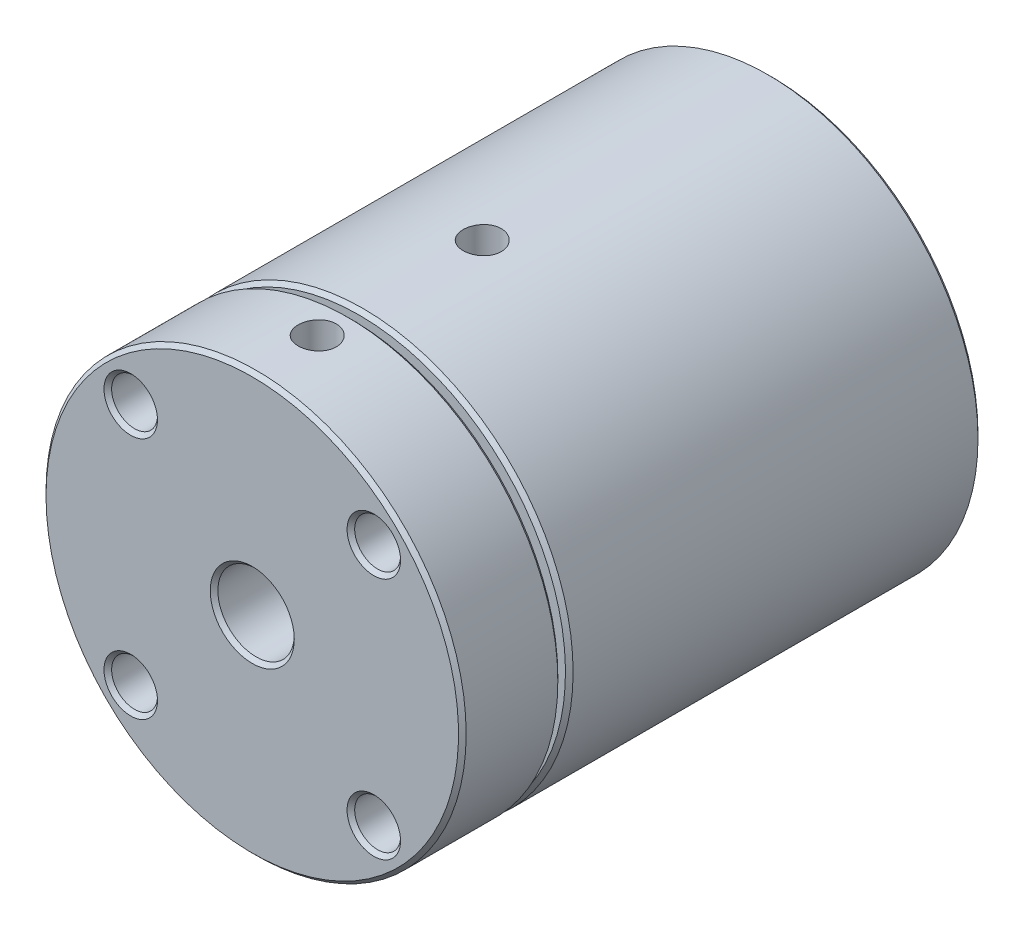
ISO-10303-21;
HEADER;
FILE_DESCRIPTION(('STEP AP214'),'2;1');
FILE_NAME('part.step','',(''),(''),'','','');
FILE_SCHEMA(('AUTOMOTIVE_DESIGN { 1 0 10303 214 1 1 1 1 }'));
ENDSEC;
DATA;
#1=APPLICATION_CONTEXT('core data for automotive mechanical design processes');
#2=APPLICATION_PROTOCOL_DEFINITION('international standard','automotive_design',2000,#1);
#3=PRODUCT_CONTEXT('',#1,'mechanical');
#4=PRODUCT('Part','Part','',(#3));
#5=PRODUCT_RELATED_PRODUCT_CATEGORY('part','',(#4));
#6=PRODUCT_DEFINITION_FORMATION('','',#4);
#7=PRODUCT_DEFINITION_CONTEXT('part definition',#1,'design');
#8=PRODUCT_DEFINITION('design','',#6,#7);
#9=PRODUCT_DEFINITION_SHAPE('','',#8);
#10=(LENGTH_UNIT() NAMED_UNIT(*) SI_UNIT(.MILLI.,.METRE.));
#11=(NAMED_UNIT(*) PLANE_ANGLE_UNIT() SI_UNIT($,.RADIAN.));
#12=(NAMED_UNIT(*) SI_UNIT($,.STERADIAN.) SOLID_ANGLE_UNIT());
#13=UNCERTAINTY_MEASURE_WITH_UNIT(LENGTH_MEASURE(1.E-05),#10,'distance_accuracy_value','');
#14=(GEOMETRIC_REPRESENTATION_CONTEXT(3) GLOBAL_UNCERTAINTY_ASSIGNED_CONTEXT((#13)) GLOBAL_UNIT_ASSIGNED_CONTEXT((#10,
#11,#12)) REPRESENTATION_CONTEXT('',''));
#15=CARTESIAN_POINT('',(0.,0.,0.));
#16=DIRECTION('',(0.,0.,1.));
#17=DIRECTION('',(1.,0.,0.));
#18=AXIS2_PLACEMENT_3D('',#15,#16,#17);
#19=CARTESIAN_POINT('',(0.,-22.5,-62.));
#20=DIRECTION('',(0.,0.,1.));
#21=DIRECTION('',(1.,0.,0.));
#22=AXIS2_PLACEMENT_3D('',#19,#20,#21);
#23=PLANE('',#22);
#24=CARTESIAN_POINT('',(0.,-22.5,-62.));
#25=DIRECTION('',(0.,0.,1.));
#26=DIRECTION('',(1.,0.,0.));
#27=AXIS2_PLACEMENT_3D('',#24,#25,#26);
#28=CIRCLE('',#27,3.);
#29=CARTESIAN_POINT('',(3.,-22.5,-62.));
#30=VERTEX_POINT('',#29);
#31=EDGE_CURVE('P0_E17',#30,#30,#28,.F.);
#32=ORIENTED_EDGE('',*,*,#31,.T.);
#33=EDGE_LOOP('',(#32));
#34=FACE_BOUND('',#33,.T.);
#35=ADVANCED_FACE('P0_F14',(#34),#23,.F.);
#36=CARTESIAN_POINT('',(-22.5,0.,-62.));
#37=DIRECTION('',(0.,0.,1.));
#38=DIRECTION('',(1.,0.,0.));
#39=AXIS2_PLACEMENT_3D('',#36,#37,#38);
#40=PLANE('',#39);
#41=CARTESIAN_POINT('',(-22.5,0.,-62.));
#42=DIRECTION('',(0.,0.,1.));
#43=DIRECTION('',(1.,0.,0.));
#44=AXIS2_PLACEMENT_3D('',#41,#42,#43);
#45=CIRCLE('',#44,3.);
#46=CARTESIAN_POINT('',(-19.5,0.,-62.));
#47=VERTEX_POINT('',#46);
#48=EDGE_CURVE('P0_E111',#47,#47,#45,.F.);
#49=ORIENTED_EDGE('',*,*,#48,.T.);
#50=EDGE_LOOP('',(#49));
#51=FACE_BOUND('',#50,.T.);
#52=ADVANCED_FACE('P0_F138',(#51),#40,.F.);
#53=CARTESIAN_POINT('',(22.5,0.,-62.));
#54=DIRECTION('',(0.,0.,1.));
#55=DIRECTION('',(1.,0.,0.));
#56=AXIS2_PLACEMENT_3D('',#53,#54,#55);
#57=PLANE('',#56);
#58=CARTESIAN_POINT('',(22.5,0.,-62.));
#59=DIRECTION('',(0.,0.,1.));
#60=DIRECTION('',(1.,0.,0.));
#61=AXIS2_PLACEMENT_3D('',#58,#59,#60);
#62=CIRCLE('',#61,3.);
#63=CARTESIAN_POINT('',(25.5,0.,-62.));
#64=VERTEX_POINT('',#63);
#65=EDGE_CURVE('P0_E105',#64,#64,#62,.F.);
#66=ORIENTED_EDGE('',*,*,#65,.T.);
#67=EDGE_LOOP('',(#66));
#68=FACE_BOUND('',#67,.T.);
#69=ADVANCED_FACE('P0_F132',(#68),#57,.F.);
#70=CARTESIAN_POINT('',(0.,22.5,-62.));
#71=DIRECTION('',(0.,0.,1.));
#72=DIRECTION('',(1.,0.,0.));
#73=AXIS2_PLACEMENT_3D('',#70,#71,#72);
#74=PLANE('',#73);
#75=CARTESIAN_POINT('',(0.,22.5,-62.));
#76=DIRECTION('',(0.,0.,1.));
#77=DIRECTION('',(1.,0.,0.));
#78=AXIS2_PLACEMENT_3D('',#75,#76,#77);
#79=CIRCLE('',#78,3.);
#80=CARTESIAN_POINT('',(3.,22.5,-62.));
#81=VERTEX_POINT('',#80);
#82=EDGE_CURVE('P0_E100',#81,#81,#79,.F.);
#83=ORIENTED_EDGE('',*,*,#82,.T.);
#84=EDGE_LOOP('',(#83));
#85=FACE_BOUND('',#84,.T.);
#86=ADVANCED_FACE('P0_F122',(#85),#74,.F.);
#87=CARTESIAN_POINT('',(0.,-22.5,-72.));
#88=DIRECTION('',(0.,0.,1.));
#89=DIRECTION('',(1.,0.,0.));
#90=AXIS2_PLACEMENT_3D('',#87,#88,#89);
#91=CYLINDRICAL_SURFACE('',#90,3.);
#92=ORIENTED_EDGE('',*,*,#31,.F.);
#93=EDGE_LOOP('',(#92));
#94=FACE_BOUND('',#93,.T.);
#95=CARTESIAN_POINT('',(0.,-22.5,-71.4999999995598));
#96=DIRECTION('',(0.,0.,-1.));
#97=DIRECTION('',(-1.,0.,0.));
#98=AXIS2_PLACEMENT_3D('',#95,#96,#97);
#99=CIRCLE('',#98,3.00000000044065);
#100=CARTESIAN_POINT('',(-3.00000000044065,-22.5,-71.4999999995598));
#101=VERTEX_POINT('',#100);
#102=EDGE_CURVE('P0_E93',#101,#101,#99,.T.);
#103=ORIENTED_EDGE('',*,*,#102,.T.);
#104=EDGE_LOOP('',(#103));
#105=FACE_BOUND('',#104,.T.);
#106=ADVANCED_FACE('P0_F119',(#94,#105),#91,.F.);
#107=CARTESIAN_POINT('',(-22.5,0.,-72.));
#108=DIRECTION('',(0.,0.,1.));
#109=DIRECTION('',(1.,0.,0.));
#110=AXIS2_PLACEMENT_3D('',#107,#108,#109);
#111=CYLINDRICAL_SURFACE('',#110,3.);
#112=ORIENTED_EDGE('',*,*,#48,.F.);
#113=EDGE_LOOP('',(#112));
#114=FACE_BOUND('',#113,.T.);
#115=CARTESIAN_POINT('',(-22.5,0.,-71.4999999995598));
#116=DIRECTION('',(0.,0.,-1.));
#117=DIRECTION('',(-1.,0.,0.));
#118=AXIS2_PLACEMENT_3D('',#115,#116,#117);
#119=CIRCLE('',#118,3.00000000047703);
#120=CARTESIAN_POINT('',(-25.500000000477,0.,-71.4999999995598));
#121=VERTEX_POINT('',#120);
#122=EDGE_CURVE('P0_E88',#121,#121,#119,.T.);
#123=ORIENTED_EDGE('',*,*,#122,.T.);
#124=EDGE_LOOP('',(#123));
#125=FACE_BOUND('',#124,.T.);
#126=ADVANCED_FACE('P0_F121',(#114,#125),#111,.F.);
#127=CARTESIAN_POINT('',(0.,0.,-66.1));
#128=DIRECTION('',(0.,0.,-1.));
#129=DIRECTION('',(0.,1.,0.));
#130=AXIS2_PLACEMENT_3D('',#127,#128,#129);
#131=CYLINDRICAL_SURFACE('',#130,5.5);
#132=CARTESIAN_POINT('',(0.,0.,-67.6));
#133=DIRECTION('',(0.,0.,-1.));
#134=DIRECTION('',(0.,1.,0.));
#135=AXIS2_PLACEMENT_3D('',#132,#133,#134);
#136=CIRCLE('',#135,5.5);
#137=CARTESIAN_POINT('',(0.,5.50000000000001,-67.6));
#138=VERTEX_POINT('',#137);
#139=EDGE_CURVE('P0_E96',#138,#138,#136,.F.);
#140=ORIENTED_EDGE('',*,*,#139,.T.);
#141=EDGE_LOOP('',(#140));
#142=FACE_BOUND('',#141,.T.);
#143=CARTESIAN_POINT('',(0.,0.,-71.4999999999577));
#144=DIRECTION('',(0.,0.,-1.));
#145=DIRECTION('',(0.,1.,0.));
#146=AXIS2_PLACEMENT_3D('',#143,#144,#145);
#147=CIRCLE('',#146,5.49999999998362);
#148=CARTESIAN_POINT('',(0.,5.49999999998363,-71.4999999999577));
#149=VERTEX_POINT('',#148);
#150=EDGE_CURVE('P0_E83',#149,#149,#147,.T.);
#151=ORIENTED_EDGE('',*,*,#150,.T.);
#152=EDGE_LOOP('',(#151));
#153=FACE_BOUND('',#152,.T.);
#154=ADVANCED_FACE('P0_F129',(#142,#153),#131,.F.);
#155=CARTESIAN_POINT('',(22.5,0.,-72.));
#156=DIRECTION('',(0.,0.,1.));
#157=DIRECTION('',(1.,0.,0.));
#158=AXIS2_PLACEMENT_3D('',#155,#156,#157);
#159=CYLINDRICAL_SURFACE('',#158,3.);
#160=ORIENTED_EDGE('',*,*,#65,.F.);
#161=EDGE_LOOP('',(#160));
#162=FACE_BOUND('',#161,.T.);
#163=CARTESIAN_POINT('',(22.5,0.,-71.5000000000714));
#164=DIRECTION('',(0.,0.,-1.));
#165=DIRECTION('',(-1.,0.,0.));
#166=AXIS2_PLACEMENT_3D('',#163,#164,#165);
#167=CIRCLE('',#166,2.99999999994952);
#168=CARTESIAN_POINT('',(19.5000000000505,0.,-71.5000000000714));
#169=VERTEX_POINT('',#168);
#170=EDGE_CURVE('P0_E78',#169,#169,#167,.T.);
#171=ORIENTED_EDGE('',*,*,#170,.T.);
#172=EDGE_LOOP('',(#171));
#173=FACE_BOUND('',#172,.T.);
#174=ADVANCED_FACE('P0_F165',(#162,#173),#159,.F.);
#175=CARTESIAN_POINT('',(0.,22.5,-72.));
#176=DIRECTION('',(0.,0.,1.));
#177=DIRECTION('',(1.,0.,0.));
#178=AXIS2_PLACEMENT_3D('',#175,#176,#177);
#179=CYLINDRICAL_SURFACE('',#178,3.);
#180=ORIENTED_EDGE('',*,*,#82,.F.);
#181=EDGE_LOOP('',(#180));
#182=FACE_BOUND('',#181,.T.);
#183=CARTESIAN_POINT('',(0.,22.5,-71.4999999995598));
#184=DIRECTION('',(0.,0.,-1.));
#185=DIRECTION('',(-1.,0.,0.));
#186=AXIS2_PLACEMENT_3D('',#183,#184,#185);
#187=CIRCLE('',#186,3.00000000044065);
#188=CARTESIAN_POINT('',(-3.00000000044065,22.5,-71.4999999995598));
#189=VERTEX_POINT('',#188);
#190=EDGE_CURVE('P0_E74',#189,#189,#187,.T.);
#191=ORIENTED_EDGE('',*,*,#190,.T.);
#192=EDGE_LOOP('',(#191));
#193=FACE_BOUND('',#192,.T.);
#194=ADVANCED_FACE('P0_F174',(#182,#193),#179,.F.);
#195=CARTESIAN_POINT('',(0.,0.,-67.6));
#196=DIRECTION('',(0.,0.,-1.));
#197=DIRECTION('',(0.,1.,0.));
#198=AXIS2_PLACEMENT_3D('',#195,#196,#197);
#199=PLANE('',#198);
#200=CARTESIAN_POINT('',(0.,0.,-67.6));
#201=DIRECTION('',(0.,0.,1.));
#202=DIRECTION('',(0.,-1.,0.));
#203=AXIS2_PLACEMENT_3D('',#200,#201,#202);
#204=CIRCLE('',#203,15.);
#205=CARTESIAN_POINT('',(0.,-15.,-67.6));
#206=VERTEX_POINT('',#205);
#207=EDGE_CURVE('P0_E77',#206,#206,#204,.T.);
#208=ORIENTED_EDGE('',*,*,#207,.T.);
#209=EDGE_LOOP('',(#208));
#210=FACE_BOUND('',#209,.T.);
#211=ORIENTED_EDGE('',*,*,#139,.F.);
#212=EDGE_LOOP('',(#211));
#213=FACE_BOUND('',#212,.T.);
#214=ADVANCED_FACE('P0_F184',(#210,#213),#199,.F.);
#215=CARTESIAN_POINT('',(0.,0.,-48.8));
#216=DIRECTION('',(0.,0.,1.));
#217=DIRECTION('',(0.,-1.,0.));
#218=AXIS2_PLACEMENT_3D('',#215,#216,#217);
#219=CYLINDRICAL_SURFACE('',#218,17.15);
#220=CARTESIAN_POINT('',(0.,-17.15,-44.8));
#221=CARTESIAN_POINT('',(0.084083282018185,-17.1499991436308,-44.799996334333));
#222=CARTESIAN_POINT('',(0.168223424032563,-17.1493750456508,-44.7929062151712));
#223=CARTESIAN_POINT('',(0.334174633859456,-17.1469454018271,-44.7647273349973));
#224=CARTESIAN_POINT('',(0.415982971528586,-17.1451385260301,-44.7436228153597));
#225=CARTESIAN_POINT('',(0.574843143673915,-17.1405474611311,-44.6880310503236));
#226=CARTESIAN_POINT('',(0.651897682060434,-17.1377638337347,-44.6535514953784));
#227=CARTESIAN_POINT('',(0.799107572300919,-17.1315312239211,-44.5722024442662));
#228=CARTESIAN_POINT('',(0.869264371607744,-17.1280823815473,-44.5253355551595));
#229=CARTESIAN_POINT('',(1.00090119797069,-17.1208954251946,-44.4204011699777));
#230=CARTESIAN_POINT('',(1.06235930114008,-17.117156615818,-44.3623062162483));
#231=CARTESIAN_POINT('',(1.17466597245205,-17.1098169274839,-44.2366229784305));
#232=CARTESIAN_POINT('',(1.22551406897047,-17.1062160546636,-44.1690342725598));
#233=CARTESIAN_POINT('',(1.31523245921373,-17.0995525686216,-44.0261481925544));
#234=CARTESIAN_POINT('',(1.35408333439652,-17.0964908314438,-43.9508385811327));
#235=CARTESIAN_POINT('',(1.41858042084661,-17.0912604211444,-43.7947336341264));
#236=CARTESIAN_POINT('',(1.44422688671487,-17.0890917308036,-43.7139384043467));
#237=CARTESIAN_POINT('',(1.48152318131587,-17.0858989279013,-43.5493764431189));
#238=CARTESIAN_POINT('',(1.49320890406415,-17.0848718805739,-43.4656179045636));
#239=CARTESIAN_POINT('',(1.50236290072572,-17.0840694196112,-43.2973224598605));
#240=CARTESIAN_POINT('',(1.49983146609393,-17.0842939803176,-43.2127855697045));
#241=CARTESIAN_POINT('',(1.48065265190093,-17.0859666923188,-43.0455794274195));
#242=CARTESIAN_POINT('',(1.46404432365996,-17.0874114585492,-42.9629056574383));
#243=CARTESIAN_POINT('',(1.41724386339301,-17.0913564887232,-42.80152364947));
#244=CARTESIAN_POINT('',(1.38705158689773,-17.0938567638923,-42.722815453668));
#245=CARTESIAN_POINT('',(1.31389669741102,-17.0996349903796,-42.5714746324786));
#246=CARTESIAN_POINT('',(1.27091660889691,-17.1029140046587,-42.4988504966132));
#247=CARTESIAN_POINT('',(1.17341873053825,-17.1098792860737,-42.361832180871));
#248=CARTESIAN_POINT('',(1.11890068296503,-17.1135655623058,-42.2974381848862));
#249=CARTESIAN_POINT('',(0.999655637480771,-17.1209450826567,-42.1784810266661));
#250=CARTESIAN_POINT('',(0.934894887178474,-17.1246383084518,-42.1239516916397));
#251=CARTESIAN_POINT('',(0.797120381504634,-17.131603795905,-42.0265334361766));
#252=CARTESIAN_POINT('',(0.724106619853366,-17.1348760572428,-41.9836445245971));
#253=CARTESIAN_POINT('',(0.57187636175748,-17.1406316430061,-41.9107265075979));
#254=CARTESIAN_POINT('',(0.492659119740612,-17.1431148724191,-41.8806989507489));
#255=CARTESIAN_POINT('',(0.330280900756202,-17.1470115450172,-41.8343799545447));
#256=CARTESIAN_POINT('',(0.247120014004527,-17.148425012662,-41.8180882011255));
#257=CARTESIAN_POINT('',(0.0795082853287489,-17.1500197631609,-41.7997458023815));
#258=CARTESIAN_POINT('',(-0.00493740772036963,-17.1502050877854,-41.7976484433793));
#259=CARTESIAN_POINT('',(-0.172979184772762,-17.1493334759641,-41.8076319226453));
#260=CARTESIAN_POINT('',(-0.25657527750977,-17.1482765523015,-41.8197126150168));
#261=CARTESIAN_POINT('',(-0.420411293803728,-17.1450418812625,-41.857670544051));
#262=CARTESIAN_POINT('',(-0.50065628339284,-17.1428658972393,-41.8835260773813));
#263=CARTESIAN_POINT('',(-0.655669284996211,-17.1376374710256,-41.9482775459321));
#264=CARTESIAN_POINT('',(-0.730437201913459,-17.1345850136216,-41.9871737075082));
#265=CARTESIAN_POINT('',(-0.872585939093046,-17.1279355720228,-42.0770193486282));
#266=CARTESIAN_POINT('',(-0.939947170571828,-17.1243372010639,-42.1279997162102));
#267=CARTESIAN_POINT('',(-1.06517253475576,-17.1170046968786,-42.2405220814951));
#268=CARTESIAN_POINT('',(-1.12303648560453,-17.1132705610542,-42.3020642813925));
#269=CARTESIAN_POINT('',(-1.22778543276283,-17.1060753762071,-42.4341663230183));
#270=CARTESIAN_POINT('',(-1.27463990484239,-17.1026151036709,-42.5047504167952));
#271=CARTESIAN_POINT('',(-1.35583044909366,-17.0963706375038,-42.6528121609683));
#272=CARTESIAN_POINT('',(-1.39016665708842,-17.0935864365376,-42.7302897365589));
#273=CARTESIAN_POINT('',(-1.44529420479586,-17.0890138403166,-42.8898318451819));
#274=CARTESIAN_POINT('',(-1.46610410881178,-17.0872240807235,-42.971889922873));
#275=CARTESIAN_POINT('',(-1.49364872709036,-17.0848385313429,-43.1383518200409));
#276=CARTESIAN_POINT('',(-1.50038374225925,-17.0842427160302,-43.2227555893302));
#277=CARTESIAN_POINT('',(-1.49958376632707,-17.0843129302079,-43.3912096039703));
#278=CARTESIAN_POINT('',(-1.49209673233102,-17.0849747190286,-43.4752600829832));
#279=CARTESIAN_POINT('',(-1.4631653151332,-17.0874765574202,-43.6409048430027));
#280=CARTESIAN_POINT('',(-1.4417209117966,-17.0893166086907,-43.7224991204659));
#281=CARTESIAN_POINT('',(-1.38549589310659,-17.0939665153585,-43.8809176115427));
#282=CARTESIAN_POINT('',(-1.35071627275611,-17.0967762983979,-43.9577421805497));
#283=CARTESIAN_POINT('',(-1.26881333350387,-17.1030492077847,-44.1044700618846));
#284=CARTESIAN_POINT('',(-1.22169017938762,-17.1065123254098,-44.1743734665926));
#285=CARTESIAN_POINT('',(-1.11625753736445,-17.1137156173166,-44.3055202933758));
#286=CARTESIAN_POINT('',(-1.05791246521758,-17.1174566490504,-44.3667350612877));
#287=CARTESIAN_POINT('',(-0.931758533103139,-17.1247864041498,-44.4785286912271));
#288=CARTESIAN_POINT('',(-0.863947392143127,-17.1283750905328,-44.5291049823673));
#289=CARTESIAN_POINT('',(-0.720642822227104,-17.1350029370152,-44.6182610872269));
#290=CARTESIAN_POINT('',(-0.645134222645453,-17.1380409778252,-44.6568165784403));
#291=CARTESIAN_POINT('',(-0.488739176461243,-17.1432123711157,-44.7206518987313));
#292=CARTESIAN_POINT('',(-0.407859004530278,-17.1453467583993,-44.7459469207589));
#293=CARTESIAN_POINT('',(-0.27208837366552,-17.1479251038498,-44.7761321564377));
#294=CARTESIAN_POINT('',(-0.218069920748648,-17.1486996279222,-44.7850706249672));
#295=CARTESIAN_POINT('',(-0.109375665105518,-17.1497373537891,-44.7970057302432));
#296=CARTESIAN_POINT('',(-0.0546998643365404,-17.1500005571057,-44.8000023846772));
#297=CARTESIAN_POINT('',(0.,-17.15,-44.8));
#298=B_SPLINE_CURVE_WITH_KNOTS('',3,(#220,#221,#222,#223,#224,#225,#226,#227,#228,#229,#230,
#231,#232,#233,#234,#235,#236,#237,#238,#239,#240,#241,#242,#243,#244,#245,#246,#247,#248,#249,
#250,#251,#252,#253,#254,#255,#256,#257,#258,#259,#260,#261,#262,#263,#264,#265,#266,#267,#268,
#269,#270,#271,#272,#273,#274,#275,#276,#277,#278,#279,#280,#281,#282,#283,#284,#285,#286,#287,
#288,#289,#290,#291,#292,#293,#294,#295,#296,#297),.UNSPECIFIED.,.T.,.F.,(4,2,2,2,2,2,2,2,2,2,2,
2,2,2,2,2,2,2,2,2,2,2,2,2,2,2,2,2,2,2,2,2,2,2,2,2,2,2,4),(0.,0.252050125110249,
0.504384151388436,0.756573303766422,1.00870942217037,1.26147011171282,1.51424203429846,
1.76742097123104,2.02059502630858,2.27311674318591,2.52563328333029,2.77745159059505,
3.02927257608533,3.28143928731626,3.53361163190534,3.7866329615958,4.03965448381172,
4.29270646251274,4.54575265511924,4.797965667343,5.05017608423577,5.30199029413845,
5.55380887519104,5.80627819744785,6.05875235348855,6.31191845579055,6.56508181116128,
6.81789697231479,7.07070672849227,7.32266551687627,7.57462466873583,7.82656502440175,
8.07850201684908,8.33125146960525,8.58406193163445,8.8373806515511,9.09040849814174,
9.25437865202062,9.41834831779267),.UNSPECIFIED.);
#299=CARTESIAN_POINT('',(0.,-17.15,-44.8));
#300=VERTEX_POINT('',#299);
#301=EDGE_CURVE('P0_E399',#300,#300,#298,.T.);
#302=ORIENTED_EDGE('',*,*,#301,.T.);
#303=EDGE_LOOP('',(#302));
#304=FACE_BOUND('',#303,.T.);
#305=ADVANCED_FACE('P0_F194',(#304),#219,.T.);
#306=CARTESIAN_POINT('',(0.,-22.5,-72.0000000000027));
#307=DIRECTION('',(0.,0.,-1.));
#308=DIRECTION('',(-1.,0.,0.));
#309=AXIS2_PLACEMENT_3D('',#306,#307,#308);
#310=CONICAL_SURFACE('',#309,3.49999999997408,0.785398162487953);
#311=CARTESIAN_POINT('',(0.,-22.5,-72.0000000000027));
#312=DIRECTION('',(0.,0.,-1.));
#313=DIRECTION('',(-1.,0.,0.));
#314=AXIS2_PLACEMENT_3D('',#311,#312,#313);
#315=CIRCLE('',#314,3.49999999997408);
#316=CARTESIAN_POINT('',(-3.49999999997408,-22.5,-72.0000000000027));
#317=VERTEX_POINT('',#316);
#318=EDGE_CURVE('P0_E398',#317,#317,#315,.F.);
#319=ORIENTED_EDGE('',*,*,#318,.F.);
#320=EDGE_LOOP('',(#319));
#321=FACE_BOUND('',#320,.T.);
#322=ORIENTED_EDGE('',*,*,#102,.F.);
#323=EDGE_LOOP('',(#322));
#324=FACE_BOUND('',#323,.T.);
#325=ADVANCED_FACE('P0_F204',(#321,#324),#310,.F.);
#326=CARTESIAN_POINT('',(-22.5,0.,-71.999999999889));
#327=DIRECTION('',(0.,0.,-1.));
#328=DIRECTION('',(-1.,0.,0.));
#329=AXIS2_PLACEMENT_3D('',#326,#327,#328);
#330=CONICAL_SURFACE('',#329,3.49999999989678,0.785398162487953);
#331=CARTESIAN_POINT('',(-22.5,0.,-71.9999999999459));
#332=DIRECTION('',(0.,0.,-1.));
#333=DIRECTION('',(-1.,0.,0.));
#334=AXIS2_PLACEMENT_3D('',#331,#332,#333);
#335=CIRCLE('',#334,3.49999999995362);
#336=CARTESIAN_POINT('',(-25.9999999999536,0.,-71.9999999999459));
#337=VERTEX_POINT('',#336);
#338=EDGE_CURVE('P0_E433',#337,#337,#335,.F.);
#339=ORIENTED_EDGE('',*,*,#338,.F.);
#340=EDGE_LOOP('',(#339));
#341=FACE_BOUND('',#340,.T.);
#342=ORIENTED_EDGE('',*,*,#122,.F.);
#343=EDGE_LOOP('',(#342));
#344=FACE_BOUND('',#343,.T.);
#345=ADVANCED_FACE('P0_F214',(#341,#344),#330,.F.);
#346=CARTESIAN_POINT('',(0.,0.,-72.0000000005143));
#347=DIRECTION('',(0.,0.,-1.));
#348=DIRECTION('',(-1.,0.,0.));
#349=AXIS2_PLACEMENT_3D('',#346,#347,#348);
#350=CONICAL_SURFACE('',#349,5.99999999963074,0.785398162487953);
#351=ORIENTED_EDGE('',*,*,#150,.F.);
#352=EDGE_LOOP('',(#351));
#353=FACE_BOUND('',#352,.T.);
#354=CARTESIAN_POINT('',(0.,0.,-72.0000000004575));
#355=DIRECTION('',(0.,0.,-1.));
#356=DIRECTION('',(-1.,0.,0.));
#357=AXIS2_PLACEMENT_3D('',#354,#355,#356);
#358=CIRCLE('',#357,5.99999999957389);
#359=CARTESIAN_POINT('',(-5.99999999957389,0.,-72.0000000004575));
#360=VERTEX_POINT('',#359);
#361=EDGE_CURVE('P0_E431',#360,#360,#358,.F.);
#362=ORIENTED_EDGE('',*,*,#361,.F.);
#363=EDGE_LOOP('',(#362));
#364=FACE_BOUND('',#363,.T.);
#365=ADVANCED_FACE('P0_F224',(#353,#364),#350,.F.);
#366=CARTESIAN_POINT('',(22.5,0.,-72.0000000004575));
#367=DIRECTION('',(0.,0.,-1.));
#368=DIRECTION('',(-1.,0.,0.));
#369=AXIS2_PLACEMENT_3D('',#366,#367,#368);
#370=CONICAL_SURFACE('',#369,3.49999999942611,0.785398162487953);
#371=ORIENTED_EDGE('',*,*,#170,.F.);
#372=EDGE_LOOP('',(#371));
#373=FACE_BOUND('',#372,.T.);
#374=CARTESIAN_POINT('',(22.5,0.,-72.0000000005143));
#375=DIRECTION('',(0.,0.,-1.));
#376=DIRECTION('',(-1.,0.,0.));
#377=AXIS2_PLACEMENT_3D('',#374,#375,#376);
#378=CIRCLE('',#377,3.49999999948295);
#379=CARTESIAN_POINT('',(19.000000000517,0.,-72.0000000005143));
#380=VERTEX_POINT('',#379);
#381=EDGE_CURVE('P0_E425',#380,#380,#378,.F.);
#382=ORIENTED_EDGE('',*,*,#381,.F.);
#383=EDGE_LOOP('',(#382));
#384=FACE_BOUND('',#383,.T.);
#385=ADVANCED_FACE('P0_F234',(#373,#384),#370,.F.);
#386=CARTESIAN_POINT('',(0.,22.5,-72.0000000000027));
#387=DIRECTION('',(0.,0.,-1.));
#388=DIRECTION('',(-1.,0.,0.));
#389=AXIS2_PLACEMENT_3D('',#386,#387,#388);
#390=CONICAL_SURFACE('',#389,3.49999999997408,0.785398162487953);
#391=CARTESIAN_POINT('',(0.,22.5,-72.0000000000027));
#392=DIRECTION('',(0.,0.,-1.));
#393=DIRECTION('',(-1.,0.,0.));
#394=AXIS2_PLACEMENT_3D('',#391,#392,#393);
#395=CIRCLE('',#394,3.49999999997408);
#396=CARTESIAN_POINT('',(-3.49999999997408,22.5,-72.0000000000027));
#397=VERTEX_POINT('',#396);
#398=EDGE_CURVE('P0_E419',#397,#397,#395,.F.);
#399=ORIENTED_EDGE('',*,*,#398,.F.);
#400=EDGE_LOOP('',(#399));
#401=FACE_BOUND('',#400,.T.);
#402=ORIENTED_EDGE('',*,*,#190,.F.);
#403=EDGE_LOOP('',(#402));
#404=FACE_BOUND('',#403,.T.);
#405=ADVANCED_FACE('P0_F244',(#401,#404),#390,.F.);
#406=CARTESIAN_POINT('',(0.,0.,-86.65));
#407=DIRECTION('',(0.,0.,1.));
#408=DIRECTION('',(0.,-1.,0.));
#409=AXIS2_PLACEMENT_3D('',#406,#407,#408);
#410=CYLINDRICAL_SURFACE('',#409,15.);
#411=ORIENTED_EDGE('',*,*,#207,.F.);
#412=EDGE_LOOP('',(#411));
#413=FACE_BOUND('',#412,.T.);
#414=CARTESIAN_POINT('',(0.,0.,-18.));
#415=DIRECTION('',(0.,0.,1.));
#416=DIRECTION('',(0.,-1.,0.));
#417=AXIS2_PLACEMENT_3D('',#414,#415,#416);
#418=CIRCLE('',#417,15.);
#419=CARTESIAN_POINT('',(0.,-15.,-18.));
#420=VERTEX_POINT('',#419);
#421=EDGE_CURVE('P0_E415',#420,#420,#418,.F.);
#422=ORIENTED_EDGE('',*,*,#421,.F.);
#423=EDGE_LOOP('',(#422));
#424=FACE_BOUND('',#423,.T.);
#425=CARTESIAN_POINT('',(0.,15.,-35.6));
#426=CARTESIAN_POINT('',(-0.084030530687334,14.9999990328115,-35.5999963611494));
#427=CARTESIAN_POINT('',(-0.168116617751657,14.9992863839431,-35.5929150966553));
#428=CARTESIAN_POINT('',(-0.333957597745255,14.996512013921,-35.5647734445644));
#429=CARTESIAN_POINT('',(-0.415709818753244,14.9944488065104,-35.5436976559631));
#430=CARTESIAN_POINT('',(-0.57445751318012,14.989206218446,-35.4881866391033));
#431=CARTESIAN_POINT('',(-0.651455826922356,14.9860275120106,-35.4537594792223));
#432=CARTESIAN_POINT('',(-0.798564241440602,14.9789093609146,-35.3725386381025));
#433=CARTESIAN_POINT('',(-0.868675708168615,14.9749700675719,-35.3257474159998));
#434=CARTESIAN_POINT('',(-1.00028932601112,14.9667561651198,-35.2209459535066));
#435=CARTESIAN_POINT('',(-1.06176321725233,14.962480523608,-35.162900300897));
#436=CARTESIAN_POINT('',(-1.17411378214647,14.9540843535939,-35.0373131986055));
#437=CARTESIAN_POINT('',(-1.22498996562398,14.9499638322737,-34.9697713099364));
#438=CARTESIAN_POINT('',(-1.31480095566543,14.9423338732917,-34.8269322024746));
#439=CARTESIAN_POINT('',(-1.35371019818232,14.9388257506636,-34.7516188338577));
#440=CARTESIAN_POINT('',(-1.41831957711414,14.9328305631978,-34.5954866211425));
#441=CARTESIAN_POINT('',(-1.44402003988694,14.9303434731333,-34.5146679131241));
#442=CARTESIAN_POINT('',(-1.48139856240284,14.9266812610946,-34.350107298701));
#443=CARTESIAN_POINT('',(-1.49312347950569,14.9255017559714,-34.2663761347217));
#444=CARTESIAN_POINT('',(-1.50236292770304,14.9245746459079,-34.0981267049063));
#445=CARTESIAN_POINT('',(-1.4998778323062,14.9248270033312,-34.0136084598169));
#446=CARTESIAN_POINT('',(-1.48080642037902,14.926731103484,-33.84650703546));
#447=CARTESIAN_POINT('',(-1.46427126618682,14.9283777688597,-33.763917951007));
#448=CARTESIAN_POINT('',(-1.41764871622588,14.9328770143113,-33.6026930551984));
#449=CARTESIAN_POINT('',(-1.38756113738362,14.9357296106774,-33.5240572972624));
#450=CARTESIAN_POINT('',(-1.31463134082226,14.942325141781,-33.3728096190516));
#451=CARTESIAN_POINT('',(-1.27176642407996,14.9460696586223,-33.300208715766));
#452=CARTESIAN_POINT('',(-1.17451504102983,14.9540257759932,-33.1632121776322));
#453=CARTESIAN_POINT('',(-1.12012823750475,14.9582373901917,-33.0988167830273));
#454=CARTESIAN_POINT('',(-1.0010911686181,14.9666757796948,-32.9797619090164));
#455=CARTESIAN_POINT('',(-0.936396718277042,14.9709025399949,-32.9251465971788));
#456=CARTESIAN_POINT('',(-0.798734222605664,14.9788774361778,-32.8275445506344));
#457=CARTESIAN_POINT('',(-0.725766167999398,14.9826255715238,-32.7845578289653));
#458=CARTESIAN_POINT('',(-0.573597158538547,14.9892221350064,-32.7114349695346));
#459=CARTESIAN_POINT('',(-0.494395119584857,14.9920704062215,-32.6813010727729));
#460=CARTESIAN_POINT('',(-0.3320208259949,14.9965447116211,-32.6347716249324));
#461=CARTESIAN_POINT('',(-0.248848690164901,14.9981707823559,-32.6183756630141));
#462=CARTESIAN_POINT('',(-0.0812776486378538,15.0000127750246,-32.5998435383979));
#463=CARTESIAN_POINT('',(0.00311445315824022,15.000234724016,-32.5976464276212));
#464=CARTESIAN_POINT('',(0.171065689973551,14.9992596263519,-32.6074142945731));
#465=CARTESIAN_POINT('',(0.254624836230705,14.998062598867,-32.6193790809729));
#466=CARTESIAN_POINT('',(0.418362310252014,14.9943879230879,-32.6570805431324));
#467=CARTESIAN_POINT('',(0.498547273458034,14.9919129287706,-32.682788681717));
#468=CARTESIAN_POINT('',(0.653466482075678,14.9859599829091,-32.7472177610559));
#469=CARTESIAN_POINT('',(0.728200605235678,14.9824820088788,-32.7859389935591));
#470=CARTESIAN_POINT('',(0.870372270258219,14.9748971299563,-32.8754462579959));
#471=CARTESIAN_POINT('',(0.937784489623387,14.9707881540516,-32.9262723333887));
#472=CARTESIAN_POINT('',(1.06314243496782,14.9624089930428,-33.0384891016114));
#473=CARTESIAN_POINT('',(1.12108792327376,14.9581388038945,-33.0998800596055));
#474=CARTESIAN_POINT('',(1.22607916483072,14.9499003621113,-33.2317498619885));
#475=CARTESIAN_POINT('',(1.27308491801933,14.9459332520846,-33.302260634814));
#476=CARTESIAN_POINT('',(1.35458738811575,14.9387674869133,-33.45021104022));
#477=CARTESIAN_POINT('',(1.38908427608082,14.9355688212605,-33.5276505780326));
#478=CARTESIAN_POINT('',(1.44452281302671,14.9303092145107,-33.6871231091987));
#479=CARTESIAN_POINT('',(1.46548826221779,14.9282462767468,-33.7691477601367));
#480=CARTESIAN_POINT('',(1.4933460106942,14.9254854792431,-33.9355747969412));
#481=CARTESIAN_POINT('',(1.50023871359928,14.9247875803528,-34.0199771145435));
#482=CARTESIAN_POINT('',(1.49974970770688,14.9248366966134,-34.1883660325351));
#483=CARTESIAN_POINT('',(1.49243083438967,14.9255773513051,-34.2723528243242));
#484=CARTESIAN_POINT('',(1.46385817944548,14.9284065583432,-34.4378973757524));
#485=CARTESIAN_POINT('',(1.44260438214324,14.9304951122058,-34.519455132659));
#486=CARTESIAN_POINT('',(1.38678252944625,14.9357830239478,-34.6778260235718));
#487=CARTESIAN_POINT('',(1.35221631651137,14.9389822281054,-34.7546398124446));
#488=CARTESIAN_POINT('',(1.27075733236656,14.9461312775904,-34.9013853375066));
#489=CARTESIAN_POINT('',(1.22386463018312,14.9500811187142,-34.971317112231));
#490=CARTESIAN_POINT('',(1.118847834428,14.9583073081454,-35.1026355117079));
#491=CARTESIAN_POINT('',(1.0606769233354,14.9625849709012,-35.1639846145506));
#492=CARTESIAN_POINT('',(0.934847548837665,14.9709728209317,-35.2760783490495));
#493=CARTESIAN_POINT('',(0.867186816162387,14.9750829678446,-35.3268204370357));
#494=CARTESIAN_POINT('',(0.724112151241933,14.9826834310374,-35.4163601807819));
#495=CARTESIAN_POINT('',(0.648679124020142,14.9861721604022,-35.4551274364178));
#496=CARTESIAN_POINT('',(0.492387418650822,14.9921194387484,-35.5193936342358));
#497=CARTESIAN_POINT('',(0.411534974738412,14.9945791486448,-35.5449075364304));
#498=CARTESIAN_POINT('',(0.275187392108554,14.997573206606,-35.5755809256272));
#499=CARTESIAN_POINT('',(0.22056382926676,14.9984790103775,-35.584725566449));
#500=CARTESIAN_POINT('',(0.110634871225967,14.9996927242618,-35.5969362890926));
#501=CARTESIAN_POINT('',(0.0553294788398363,15.0000006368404,-35.6000023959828));
#502=CARTESIAN_POINT('',(0.,15.,-35.6));
#503=B_SPLINE_CURVE_WITH_KNOTS('',3,(#425,#426,#427,#428,#429,#430,#431,#432,#433,#434,#435,
#436,#437,#438,#439,#440,#441,#442,#443,#444,#445,#446,#447,#448,#449,#450,#451,#452,#453,#454,
#455,#456,#457,#458,#459,#460,#461,#462,#463,#464,#465,#466,#467,#468,#469,#470,#471,#472,#473,
#474,#475,#476,#477,#478,#479,#480,#481,#482,#483,#484,#485,#486,#487,#488,#489,#490,#491,#492,
#493,#494,#495,#496,#497,#498,#499,#500,#501,#502),.UNSPECIFIED.,.T.,.F.,(4,2,2,2,2,2,2,2,2,2,2,
2,2,2,2,2,2,2,2,2,2,2,2,2,2,2,2,2,2,2,2,2,2,2,2,2,2,2,4),(0.,0.25188954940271,0.504056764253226,
0.756071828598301,1.00803680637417,1.26080785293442,1.51359058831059,1.76690963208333,
2.02022241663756,2.27268348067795,2.52513790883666,2.77667696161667,3.02821941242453,
3.28021142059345,3.5322108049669,3.78532101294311,4.03843150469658,4.29158611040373,
4.5447331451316,4.79679282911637,5.04884910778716,5.30038402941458,5.55192459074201,
5.80430911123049,6.05669996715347,6.309999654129,6.56329587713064,6.81614535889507,
7.0689875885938,7.32071443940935,7.57244157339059,7.82413388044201,8.07582477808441,
8.3285837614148,8.58140328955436,8.83485946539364,9.08802892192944,9.25388500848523,
9.41974041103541),.UNSPECIFIED.);
#504=CARTESIAN_POINT('',(0.,15.,-35.6));
#505=VERTEX_POINT('',#504);
#506=EDGE_CURVE('P0_E392',#505,#505,#503,.T.);
#507=ORIENTED_EDGE('',*,*,#506,.T.);
#508=EDGE_LOOP('',(#507));
#509=FACE_BOUND('',#508,.T.);
#510=ADVANCED_FACE('P0_F254',(#413,#424,#509),#410,.F.);
#511=CARTESIAN_POINT('',(0.,-11.4,-43.3));
#512=DIRECTION('',(0.,-1.,0.));
#513=DIRECTION('',(0.,0.,-1.));
#514=AXIS2_PLACEMENT_3D('',#511,#512,#513);
#515=CYLINDRICAL_SURFACE('',#514,1.5);
#516=ORIENTED_EDGE('',*,*,#301,.F.);
#517=EDGE_LOOP('',(#516));
#518=FACE_BOUND('',#517,.T.);
#519=CARTESIAN_POINT('',(0.,-19.5,-43.3));
#520=DIRECTION('',(0.,-1.,0.));
#521=DIRECTION('',(0.,0.,-1.));
#522=AXIS2_PLACEMENT_3D('',#519,#520,#521);
#523=CIRCLE('',#522,1.5);
#524=CARTESIAN_POINT('',(0.,-19.5,-44.8));
#525=VERTEX_POINT('',#524);
#526=EDGE_CURVE('P0_E418',#525,#525,#523,.T.);
#527=ORIENTED_EDGE('',*,*,#526,.T.);
#528=EDGE_LOOP('',(#527));
#529=FACE_BOUND('',#528,.T.);
#530=ADVANCED_FACE('P0_F264',(#518,#529),#515,.F.);
#531=CARTESIAN_POINT('',(0.,11.4,-34.1));
#532=DIRECTION('',(0.,1.,0.));
#533=DIRECTION('',(0.,0.,1.));
#534=AXIS2_PLACEMENT_3D('',#531,#532,#533);
#535=CYLINDRICAL_SURFACE('',#534,1.5);
#536=CARTESIAN_POINT('',(0.,19.5,-34.1));
#537=DIRECTION('',(0.,1.,0.));
#538=DIRECTION('',(0.,0.,1.));
#539=AXIS2_PLACEMENT_3D('',#536,#537,#538);
#540=CIRCLE('',#539,1.5);
#541=CARTESIAN_POINT('',(0.,19.5,-32.6));
#542=VERTEX_POINT('',#541);
#543=EDGE_CURVE('P0_E422',#542,#542,#540,.T.);
#544=ORIENTED_EDGE('',*,*,#543,.T.);
#545=EDGE_LOOP('',(#544));
#546=FACE_BOUND('',#545,.T.);
#547=ORIENTED_EDGE('',*,*,#506,.F.);
#548=EDGE_LOOP('',(#547));
#549=FACE_BOUND('',#548,.T.);
#550=ADVANCED_FACE('P0_F274',(#546,#549),#535,.F.);
#551=CARTESIAN_POINT('',(0.,0.,-72.));
#552=DIRECTION('',(0.,0.,-1.));
#553=DIRECTION('',(0.,1.,0.));
#554=AXIS2_PLACEMENT_3D('',#551,#552,#553);
#555=PLANE('',#554);
#556=CARTESIAN_POINT('',(0.,0.,-72.));
#557=DIRECTION('',(0.,0.,1.));
#558=DIRECTION('',(1.,0.,0.));
#559=AXIS2_PLACEMENT_3D('',#556,#557,#558);
#560=CIRCLE('',#559,27.);
#561=CARTESIAN_POINT('',(27.,0.,-72.));
#562=VERTEX_POINT('',#561);
#563=EDGE_CURVE('P0_E452',#562,#562,#560,.T.);
#564=ORIENTED_EDGE('',*,*,#563,.F.);
#565=EDGE_LOOP('',(#564));
#566=FACE_BOUND('',#565,.T.);
#567=ORIENTED_EDGE('',*,*,#398,.T.);
#568=EDGE_LOOP('',(#567));
#569=FACE_BOUND('',#568,.T.);
#570=ORIENTED_EDGE('',*,*,#381,.T.);
#571=EDGE_LOOP('',(#570));
#572=FACE_BOUND('',#571,.T.);
#573=ORIENTED_EDGE('',*,*,#361,.T.);
#574=EDGE_LOOP('',(#573));
#575=FACE_BOUND('',#574,.T.);
#576=ORIENTED_EDGE('',*,*,#338,.T.);
#577=EDGE_LOOP('',(#576));
#578=FACE_BOUND('',#577,.T.);
#579=ORIENTED_EDGE('',*,*,#318,.T.);
#580=EDGE_LOOP('',(#579));
#581=FACE_BOUND('',#580,.T.);
#582=ADVANCED_FACE('P0_F284',(#566,#569,#572,#575,#578,#581),#555,.T.);
#583=CARTESIAN_POINT('',(0.,0.,-18.));
#584=DIRECTION('',(0.,0.,1.));
#585=DIRECTION('',(1.,0.,0.));
#586=AXIS2_PLACEMENT_3D('',#583,#584,#585);
#587=PLANE('',#586);
#588=ORIENTED_EDGE('',*,*,#421,.T.);
#589=EDGE_LOOP('',(#588));
#590=FACE_BOUND('',#589,.T.);
#591=CARTESIAN_POINT('',(0.,0.,-18.));
#592=DIRECTION('',(0.,0.,-1.));
#593=DIRECTION('',(0.,1.,0.));
#594=AXIS2_PLACEMENT_3D('',#591,#592,#593);
#595=CIRCLE('',#594,27.);
#596=CARTESIAN_POINT('',(0.,27.,-18.));
#597=VERTEX_POINT('',#596);
#598=EDGE_CURVE('P0_E455',#597,#597,#595,.T.);
#599=ORIENTED_EDGE('',*,*,#598,.F.);
#600=EDGE_LOOP('',(#599));
#601=FACE_BOUND('',#600,.T.);
#602=ADVANCED_FACE('P0_F294',(#590,#601),#587,.T.);
#603=CARTESIAN_POINT('',(0.,-19.5,-43.3));
#604=DIRECTION('',(0.,1.,0.));
#605=DIRECTION('',(0.,0.,1.));
#606=AXIS2_PLACEMENT_3D('',#603,#604,#605);
#607=PLANE('',#606);
#608=ORIENTED_EDGE('',*,*,#526,.F.);
#609=EDGE_LOOP('',(#608));
#610=FACE_BOUND('',#609,.T.);
#611=CARTESIAN_POINT('',(0.,-19.5,-43.3));
#612=DIRECTION('',(0.,1.,0.));
#613=DIRECTION('',(0.,0.,1.));
#614=AXIS2_PLACEMENT_3D('',#611,#612,#613);
#615=CIRCLE('',#614,2.5);
#616=CARTESIAN_POINT('',(0.,-19.5,-40.8));
#617=VERTEX_POINT('',#616);
#618=EDGE_CURVE('P0_E68',#617,#617,#615,.F.);
#619=ORIENTED_EDGE('',*,*,#618,.T.);
#620=EDGE_LOOP('',(#619));
#621=FACE_BOUND('',#620,.T.);
#622=ADVANCED_FACE('P0_F304',(#610,#621),#607,.F.);
#623=CARTESIAN_POINT('',(0.,19.5,-34.1));
#624=DIRECTION('',(0.,-1.,0.));
#625=DIRECTION('',(0.,0.,-1.));
#626=AXIS2_PLACEMENT_3D('',#623,#624,#625);
#627=PLANE('',#626);
#628=ORIENTED_EDGE('',*,*,#543,.F.);
#629=EDGE_LOOP('',(#628));
#630=FACE_BOUND('',#629,.T.);
#631=CARTESIAN_POINT('',(0.,19.5,-34.1));
#632=DIRECTION('',(0.,-1.,0.));
#633=DIRECTION('',(0.,0.,-1.));
#634=AXIS2_PLACEMENT_3D('',#631,#632,#633);
#635=CIRCLE('',#634,2.5);
#636=CARTESIAN_POINT('',(0.,19.5,-36.6));
#637=VERTEX_POINT('',#636);
#638=EDGE_CURVE('P0_E64',#637,#637,#635,.F.);
#639=ORIENTED_EDGE('',*,*,#638,.T.);
#640=EDGE_LOOP('',(#639));
#641=FACE_BOUND('',#640,.T.);
#642=ADVANCED_FACE('P0_F314',(#630,#641),#627,.F.);
#643=CARTESIAN_POINT('',(0.,0.,-71.4999999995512));
#644=DIRECTION('',(0.,0.,1.));
#645=DIRECTION('',(1.,0.,0.));
#646=AXIS2_PLACEMENT_3D('',#643,#644,#645);
#647=CONICAL_SURFACE('',#646,27.4999999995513,0.785398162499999);
#648=ORIENTED_EDGE('',*,*,#563,.T.);
#649=EDGE_LOOP('',(#648));
#650=FACE_BOUND('',#649,.T.);
#651=CARTESIAN_POINT('',(0.,0.,-71.5));
#652=DIRECTION('',(0.,0.,1.));
#653=DIRECTION('',(1.,0.,0.));
#654=AXIS2_PLACEMENT_3D('',#651,#652,#653);
#655=CIRCLE('',#654,27.5);
#656=CARTESIAN_POINT('',(27.5,0.,-71.5));
#657=VERTEX_POINT('',#656);
#658=EDGE_CURVE('P0_E62',#657,#657,#655,.T.);
#659=ORIENTED_EDGE('',*,*,#658,.F.);
#660=EDGE_LOOP('',(#659));
#661=FACE_BOUND('',#660,.T.);
#662=ADVANCED_FACE('P0_F324',(#650,#661),#647,.T.);
#663=CARTESIAN_POINT('',(0.,0.,-18.5000000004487));
#664=DIRECTION('',(0.,0.,-1.));
#665=DIRECTION('',(0.,1.,0.));
#666=AXIS2_PLACEMENT_3D('',#663,#664,#665);
#667=CONICAL_SURFACE('',#666,27.4999999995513,0.785398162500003);
#668=ORIENTED_EDGE('',*,*,#598,.T.);
#669=EDGE_LOOP('',(#668));
#670=FACE_BOUND('',#669,.T.);
#671=CARTESIAN_POINT('',(0.,0.,-18.5));
#672=DIRECTION('',(0.,0.,1.));
#673=DIRECTION('',(1.,0.,0.));
#674=AXIS2_PLACEMENT_3D('',#671,#672,#673);
#675=CIRCLE('',#674,27.5);
#676=CARTESIAN_POINT('',(27.5,0.,-18.5));
#677=VERTEX_POINT('',#676);
#678=EDGE_CURVE('P0_E26',#677,#677,#675,.F.);
#679=ORIENTED_EDGE('',*,*,#678,.F.);
#680=EDGE_LOOP('',(#679));
#681=FACE_BOUND('',#680,.T.);
#682=ADVANCED_FACE('P0_F334',(#670,#681),#667,.T.);
#683=CARTESIAN_POINT('',(0.,-30.4,-43.3));
#684=DIRECTION('',(0.,1.,0.));
#685=DIRECTION('',(0.,0.,1.));
#686=AXIS2_PLACEMENT_3D('',#683,#684,#685);
#687=CYLINDRICAL_SURFACE('',#686,2.5);
#688=ORIENTED_EDGE('',*,*,#618,.F.);
#689=EDGE_LOOP('',(#688));
#690=FACE_BOUND('',#689,.T.);
#691=CARTESIAN_POINT('',(0.,-27.5,-45.8));
#692=CARTESIAN_POINT('',(-0.140115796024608,-27.4999985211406,-45.7999939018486));
#693=CARTESIAN_POINT('',(-0.280325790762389,-27.4989177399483,-45.7881808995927));
#694=CARTESIAN_POINT('',(-0.556863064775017,-27.4947102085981,-45.7412323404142));
#695=CARTESIAN_POINT('',(-0.693185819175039,-27.4915811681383,-45.7060706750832));
#696=CARTESIAN_POINT('',(-0.957903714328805,-27.4836305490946,-45.6134529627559));
#697=CARTESIAN_POINT('',(-1.08630342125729,-27.4788099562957,-45.5560098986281));
#698=CARTESIAN_POINT('',(-1.33160898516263,-27.4680161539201,-45.4204840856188));
#699=CARTESIAN_POINT('',(-1.4485172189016,-27.462043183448,-45.3424056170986));
#700=CARTESIAN_POINT('',(-1.6679018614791,-27.4495943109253,-45.1675729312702));
#701=CARTESIAN_POINT('',(-1.77033896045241,-27.4431171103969,-45.0707694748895));
#702=CARTESIAN_POINT('',(-1.95753596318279,-27.430400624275,-44.8613392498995));
#703=CARTESIAN_POINT('',(-2.04229507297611,-27.4241613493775,-44.7487117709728));
#704=CARTESIAN_POINT('',(-2.19186610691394,-27.4126135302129,-44.5105887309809));
#705=CARTESIAN_POINT('',(-2.2566429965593,-27.4073066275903,-44.3850710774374));
#706=CARTESIAN_POINT('',(-2.36418706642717,-27.3982398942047,-44.1248842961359));
#707=CARTESIAN_POINT('',(-2.40695470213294,-27.3944800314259,-43.9902153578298));
#708=CARTESIAN_POINT('',(-2.46915102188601,-27.3889444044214,-43.7159460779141));
#709=CARTESIAN_POINT('',(-2.48864431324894,-27.3871631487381,-43.5763605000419));
#710=CARTESIAN_POINT('',(-2.50393824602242,-27.3857692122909,-43.2958882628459));
#711=CARTESIAN_POINT('',(-2.49973940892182,-27.3861564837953,-43.1550016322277));
#712=CARTESIAN_POINT('',(-2.46782160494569,-27.3890508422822,-42.8763704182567));
#713=CARTESIAN_POINT('',(-2.44017299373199,-27.3915515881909,-42.7386177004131));
#714=CARTESIAN_POINT('',(-2.36224986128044,-27.398381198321,-42.4697161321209));
#715=CARTESIAN_POINT('',(-2.31197508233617,-27.4027100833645,-42.3385673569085));
#716=CARTESIAN_POINT('',(-2.19014843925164,-27.4127155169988,-42.0863731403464));
#717=CARTESIAN_POINT('',(-2.11856516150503,-27.4183940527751,-41.965342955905));
#718=CARTESIAN_POINT('',(-1.9561761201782,-27.4304571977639,-41.7369884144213));
#719=CARTESIAN_POINT('',(-1.86536989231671,-27.4368418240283,-41.6296643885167));
#720=CARTESIAN_POINT('',(-1.66671871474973,-27.4496259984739,-41.4313597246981));
#721=CARTESIAN_POINT('',(-1.55881296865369,-27.4560255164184,-41.3404399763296));
#722=CARTESIAN_POINT('',(-1.32923747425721,-27.4680963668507,-41.1779960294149));
#723=CARTESIAN_POINT('',(-1.20756771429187,-27.4737676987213,-41.1064718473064));
#724=CARTESIAN_POINT('',(-0.953877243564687,-27.483744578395,-40.9848525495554));
#725=CARTESIAN_POINT('',(-0.821855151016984,-27.4880499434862,-40.934760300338));
#726=CARTESIAN_POINT('',(-0.551226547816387,-27.494807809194,-40.857470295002));
#727=CARTESIAN_POINT('',(-0.412620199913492,-27.4972603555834,-40.8302719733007));
#728=CARTESIAN_POINT('',(-0.133285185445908,-27.5000303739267,-40.7996186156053));
#729=CARTESIAN_POINT('',(0.0074341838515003,-27.5003554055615,-40.7960795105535));
#730=CARTESIAN_POINT('',(0.287464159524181,-27.4988539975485,-40.8126245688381));
#731=CARTESIAN_POINT('',(0.426774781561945,-27.497027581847,-40.8327084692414));
#732=CARTESIAN_POINT('',(0.699791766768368,-27.4914334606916,-40.8958597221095));
#733=CARTESIAN_POINT('',(0.833507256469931,-27.48766906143,-40.9388879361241));
#734=CARTESIAN_POINT('',(1.09182141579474,-27.4786216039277,-41.0466663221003));
#735=CARTESIAN_POINT('',(1.21641991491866,-27.4733385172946,-41.1114169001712));
#736=CARTESIAN_POINT('',(1.4533447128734,-27.4618265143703,-41.2610120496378));
#737=CARTESIAN_POINT('',(1.56563584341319,-27.4555950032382,-41.3459121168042));
#738=CARTESIAN_POINT('',(1.77440294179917,-27.4428944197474,-41.5333163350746));
#739=CARTESIAN_POINT('',(1.87087858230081,-27.436425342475,-41.6358208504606));
#740=CARTESIAN_POINT('',(2.04556601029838,-27.4239561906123,-41.8558899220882));
#741=CARTESIAN_POINT('',(2.12372280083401,-27.4179575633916,-41.973498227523));
#742=CARTESIAN_POINT('',(2.25917642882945,-27.4071297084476,-42.220219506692));
#743=CARTESIAN_POINT('',(2.3164735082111,-27.4023004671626,-42.3493323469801));
#744=CARTESIAN_POINT('',(2.40848827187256,-27.3943667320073,-42.6152055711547));
#745=CARTESIAN_POINT('',(2.44323921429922,-27.3912596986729,-42.751954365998));
#746=CARTESIAN_POINT('',(2.48928337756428,-27.3871139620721,-43.0293754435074));
#747=CARTESIAN_POINT('',(2.50057714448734,-27.386075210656,-43.1700476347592));
#748=CARTESIAN_POINT('',(2.49937951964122,-27.3861844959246,-43.4507757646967));
#749=CARTESIAN_POINT('',(2.48697452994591,-27.3873245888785,-43.5908320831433));
#750=CARTESIAN_POINT('',(2.43891212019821,-27.3916462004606,-43.8668629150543));
#751=CARTESIAN_POINT('',(2.40325466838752,-27.394827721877,-44.0028374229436));
#752=CARTESIAN_POINT('',(2.3097222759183,-27.4028715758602,-44.2668476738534));
#753=CARTESIAN_POINT('',(2.25184932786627,-27.4077337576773,-44.3948841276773));
#754=CARTESIAN_POINT('',(2.11553802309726,-27.4185913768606,-44.639438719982));
#755=CARTESIAN_POINT('',(2.03709989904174,-27.4245868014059,-44.7559569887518));
#756=CARTESIAN_POINT('',(1.86155995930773,-27.4370614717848,-44.9746103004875));
#757=CARTESIAN_POINT('',(1.76439393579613,-27.4435423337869,-45.0766937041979));
#758=CARTESIAN_POINT('',(1.55427847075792,-27.4562428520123,-45.2631476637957));
#759=CARTESIAN_POINT('',(1.4413252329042,-27.4624624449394,-45.3475139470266));
#760=CARTESIAN_POINT('',(1.202584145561,-27.4739530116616,-45.4962748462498));
#761=CARTESIAN_POINT('',(1.07676932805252,-27.4792219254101,-45.5606263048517));
#762=CARTESIAN_POINT('',(0.816155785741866,-27.4881941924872,-45.6672062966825));
#763=CARTESIAN_POINT('',(0.681367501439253,-27.4918993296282,-45.709460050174));
#764=CARTESIAN_POINT('',(0.45483141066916,-27.4963841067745,-45.7599810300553));
#765=CARTESIAN_POINT('',(0.364536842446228,-27.4977338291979,-45.7749679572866));
#766=CARTESIAN_POINT('',(0.182841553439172,-27.4995422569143,-45.7949794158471));
#767=CARTESIAN_POINT('',(0.0914408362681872,-27.5000009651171,-45.8000039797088));
#768=CARTESIAN_POINT('',(0.,-27.5,-45.8));
#769=B_SPLINE_CURVE_WITH_KNOTS('',3,(#691,#692,#693,#694,#695,#696,#697,#698,#699,#700,#701,
#702,#703,#704,#705,#706,#707,#708,#709,#710,#711,#712,#713,#714,#715,#716,#717,#718,#719,#720,
#721,#722,#723,#724,#725,#726,#727,#728,#729,#730,#731,#732,#733,#734,#735,#736,#737,#738,#739,
#740,#741,#742,#743,#744,#745,#746,#747,#748,#749,#750,#751,#752,#753,#754,#755,#756,#757,#758,
#759,#760,#761,#762,#763,#764,#765,#766,#767,#768),.UNSPECIFIED.,.T.,.F.,(4,2,2,2,2,2,2,2,2,2,2,
2,2,2,2,2,2,2,2,2,2,2,2,2,2,2,2,2,2,2,2,2,2,2,2,2,2,2,4),(0.,0.420013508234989,
0.840497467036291,1.26073678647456,1.68088900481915,2.1021614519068,2.52345281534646,
2.94547867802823,3.36749580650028,3.788338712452,4.20917235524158,4.62874783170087,
5.04832808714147,5.46852998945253,5.88874204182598,6.31048311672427,6.7322245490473,
7.15402236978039,7.57580976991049,7.99609761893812,8.41638079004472,8.83594932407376,
9.25552570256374,9.67627137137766,10.097025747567,10.5190275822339,10.9410245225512,
11.3623975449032,11.7837607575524,12.2035906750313,12.6234211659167,13.0432140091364,
13.4630021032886,13.8842558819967,14.3056111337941,14.7278687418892,15.1496433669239,
15.4237488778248,15.6978534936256),.UNSPECIFIED.);
#770=CARTESIAN_POINT('',(0.,-27.5,-45.8));
#771=VERTEX_POINT('',#770);
#772=EDGE_CURVE('P0_E21',#771,#771,#769,.T.);
#773=ORIENTED_EDGE('',*,*,#772,.F.);
#774=EDGE_LOOP('',(#773));
#775=FACE_BOUND('',#774,.T.);
#776=ADVANCED_FACE('P0_F52',(#690,#775),#687,.F.);
#777=CARTESIAN_POINT('',(0.,30.4,-34.1));
#778=DIRECTION('',(0.,-1.,0.));
#779=DIRECTION('',(0.,0.,-1.));
#780=AXIS2_PLACEMENT_3D('',#777,#778,#779);
#781=CYLINDRICAL_SURFACE('',#780,2.5);
#782=ORIENTED_EDGE('',*,*,#638,.F.);
#783=EDGE_LOOP('',(#782));
#784=FACE_BOUND('',#783,.T.);
#785=CARTESIAN_POINT('',(0.,27.5,-31.6));
#786=CARTESIAN_POINT('',(-0.140115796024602,27.4999985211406,-31.6000060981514));
#787=CARTESIAN_POINT('',(-0.280325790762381,27.4989177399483,-31.6118191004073));
#788=CARTESIAN_POINT('',(-0.556863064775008,27.4947102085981,-31.6587676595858));
#789=CARTESIAN_POINT('',(-0.693185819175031,27.4915811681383,-31.6939293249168));
#790=CARTESIAN_POINT('',(-0.957903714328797,27.4836305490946,-31.7865470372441));
#791=CARTESIAN_POINT('',(-1.08630342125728,27.4788099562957,-31.8439901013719));
#792=CARTESIAN_POINT('',(-1.33160898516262,27.4680161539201,-31.9795159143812));
#793=CARTESIAN_POINT('',(-1.44851721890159,27.462043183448,-32.0575943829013));
#794=CARTESIAN_POINT('',(-1.6679018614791,27.4495943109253,-32.2324270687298));
#795=CARTESIAN_POINT('',(-1.77033896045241,27.4431171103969,-32.3292305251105));
#796=CARTESIAN_POINT('',(-1.95753596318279,27.430400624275,-32.5386607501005));
#797=CARTESIAN_POINT('',(-2.04229507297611,27.4241613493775,-32.6512882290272));
#798=CARTESIAN_POINT('',(-2.19186610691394,27.4126135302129,-32.8894112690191));
#799=CARTESIAN_POINT('',(-2.2566429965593,27.4073066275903,-33.0149289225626));
#800=CARTESIAN_POINT('',(-2.36418706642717,27.3982398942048,-33.2751157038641));
#801=CARTESIAN_POINT('',(-2.40695470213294,27.3944800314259,-33.4097846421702));
#802=CARTESIAN_POINT('',(-2.469151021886,27.3889444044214,-33.6840539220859));
#803=CARTESIAN_POINT('',(-2.48864431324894,27.3871631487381,-33.8236394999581));
#804=CARTESIAN_POINT('',(-2.50393824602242,27.3857692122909,-34.1041117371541));
#805=CARTESIAN_POINT('',(-2.49973940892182,27.3861564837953,-34.2449983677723));
#806=CARTESIAN_POINT('',(-2.46782160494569,27.3890508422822,-34.5236295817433));
#807=CARTESIAN_POINT('',(-2.44017299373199,27.3915515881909,-34.6613822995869));
#808=CARTESIAN_POINT('',(-2.36224986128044,27.3983811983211,-34.9302838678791));
#809=CARTESIAN_POINT('',(-2.31197508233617,27.4027100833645,-35.0614326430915));
#810=CARTESIAN_POINT('',(-2.19014843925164,27.4127155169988,-35.3136268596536));
#811=CARTESIAN_POINT('',(-2.11856516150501,27.4183940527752,-35.434657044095));
#812=CARTESIAN_POINT('',(-1.9561761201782,27.4304571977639,-35.6630115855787));
#813=CARTESIAN_POINT('',(-1.86536989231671,27.4368418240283,-35.7703356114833));
#814=CARTESIAN_POINT('',(-1.66671871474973,27.4496259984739,-35.968640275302));
#815=CARTESIAN_POINT('',(-1.55881296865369,27.4560255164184,-36.0595600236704));
#816=CARTESIAN_POINT('',(-1.3292374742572,27.4680963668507,-36.2220039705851));
#817=CARTESIAN_POINT('',(-1.20756771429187,27.4737676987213,-36.2935281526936));
#818=CARTESIAN_POINT('',(-0.953877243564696,27.483744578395,-36.4151474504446));
#819=CARTESIAN_POINT('',(-0.821855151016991,27.4880499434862,-36.465239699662));
#820=CARTESIAN_POINT('',(-0.551226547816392,27.4948078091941,-36.542529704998));
#821=CARTESIAN_POINT('',(-0.412620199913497,27.4972603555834,-36.5697280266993));
#822=CARTESIAN_POINT('',(-0.133285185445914,27.5000303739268,-36.6003813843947));
#823=CARTESIAN_POINT('',(0.00743418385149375,27.5003554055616,-36.6039204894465));
#824=CARTESIAN_POINT('',(0.287464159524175,27.4988539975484,-36.5873754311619));
#825=CARTESIAN_POINT('',(0.426774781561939,27.497027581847,-36.5672915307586));
#826=CARTESIAN_POINT('',(0.69979176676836,27.4914334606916,-36.5041402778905));
#827=CARTESIAN_POINT('',(0.83350725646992,27.48766906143,-36.4611120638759));
#828=CARTESIAN_POINT('',(1.09182141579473,27.4786216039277,-36.3533336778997));
#829=CARTESIAN_POINT('',(1.21641991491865,27.4733385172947,-36.2885830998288));
#830=CARTESIAN_POINT('',(1.45334471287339,27.4618265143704,-36.1389879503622));
#831=CARTESIAN_POINT('',(1.56563584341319,27.4555950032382,-36.0540878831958));
#832=CARTESIAN_POINT('',(1.77440294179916,27.4428944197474,-35.8666836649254));
#833=CARTESIAN_POINT('',(1.8708785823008,27.436425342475,-35.7641791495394));
#834=CARTESIAN_POINT('',(2.04556601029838,27.4239561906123,-35.5441100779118));
#835=CARTESIAN_POINT('',(2.12372280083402,27.4179575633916,-35.426501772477));
#836=CARTESIAN_POINT('',(2.25917642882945,27.4071297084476,-35.179780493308));
#837=CARTESIAN_POINT('',(2.3164735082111,27.4023004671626,-35.0506676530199));
#838=CARTESIAN_POINT('',(2.40848827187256,27.3943667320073,-34.7847944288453));
#839=CARTESIAN_POINT('',(2.44323921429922,27.3912596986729,-34.648045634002));
#840=CARTESIAN_POINT('',(2.48928337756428,27.3871139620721,-34.3706245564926));
#841=CARTESIAN_POINT('',(2.50057714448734,27.386075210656,-34.2299523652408));
#842=CARTESIAN_POINT('',(2.49937951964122,27.3861844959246,-33.9492242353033));
#843=CARTESIAN_POINT('',(2.48697452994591,27.3873245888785,-33.8091679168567));
#844=CARTESIAN_POINT('',(2.43891212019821,27.3916462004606,-33.5331370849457));
#845=CARTESIAN_POINT('',(2.40325466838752,27.394827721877,-33.3971625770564));
#846=CARTESIAN_POINT('',(2.3097222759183,27.4028715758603,-33.1331523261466));
#847=CARTESIAN_POINT('',(2.25184932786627,27.4077337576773,-33.0051158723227));
#848=CARTESIAN_POINT('',(2.11553802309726,27.4185913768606,-32.760561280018));
#849=CARTESIAN_POINT('',(2.03709989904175,27.424586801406,-32.6440430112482));
#850=CARTESIAN_POINT('',(1.86155995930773,27.4370614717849,-32.4253896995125));
#851=CARTESIAN_POINT('',(1.76439393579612,27.443542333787,-32.3233062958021));
#852=CARTESIAN_POINT('',(1.55427847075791,27.4562428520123,-32.1368523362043));
#853=CARTESIAN_POINT('',(1.4413252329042,27.4624624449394,-32.0524860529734));
#854=CARTESIAN_POINT('',(1.20258414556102,27.4739530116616,-31.9037251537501));
#855=CARTESIAN_POINT('',(1.07676932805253,27.4792219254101,-31.8393736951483));
#856=CARTESIAN_POINT('',(0.816155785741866,27.4881941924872,-31.7327937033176));
#857=CARTESIAN_POINT('',(0.681367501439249,27.4918993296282,-31.690539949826));
#858=CARTESIAN_POINT('',(0.454831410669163,27.4963841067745,-31.6400189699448));
#859=CARTESIAN_POINT('',(0.364536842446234,27.4977338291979,-31.6250320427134));
#860=CARTESIAN_POINT('',(0.182841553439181,27.4995422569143,-31.6050205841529));
#861=CARTESIAN_POINT('',(0.0914408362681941,27.5000009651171,-31.5999960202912));
#862=CARTESIAN_POINT('',(0.,27.5,-31.6));
#863=B_SPLINE_CURVE_WITH_KNOTS('',3,(#785,#786,#787,#788,#789,#790,#791,#792,#793,#794,#795,
#796,#797,#798,#799,#800,#801,#802,#803,#804,#805,#806,#807,#808,#809,#810,#811,#812,#813,#814,
#815,#816,#817,#818,#819,#820,#821,#822,#823,#824,#825,#826,#827,#828,#829,#830,#831,#832,#833,
#834,#835,#836,#837,#838,#839,#840,#841,#842,#843,#844,#845,#846,#847,#848,#849,#850,#851,#852,
#853,#854,#855,#856,#857,#858,#859,#860,#861,#862),.UNSPECIFIED.,.T.,.F.,(4,2,2,2,2,2,2,2,2,2,2,
2,2,2,2,2,2,2,2,2,2,2,2,2,2,2,2,2,2,2,2,2,2,2,2,2,2,2,4),(0.,0.420013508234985,0.84049746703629,
1.26073678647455,1.68088900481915,2.1021614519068,2.52345281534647,2.94547867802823,
3.36749580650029,3.78833871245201,4.20917235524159,4.62874783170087,5.04832808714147,
5.46852998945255,5.88874204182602,6.31048311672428,6.7322245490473,7.15402236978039,
7.57580976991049,7.99609761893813,8.41638079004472,8.83594932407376,9.25552570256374,
9.67627137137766,10.097025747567,10.5190275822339,10.9410245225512,11.3623975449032,
11.7837607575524,12.2035906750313,12.6234211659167,13.0432140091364,13.4630021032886,
13.8842558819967,14.3056111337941,14.7278687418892,15.1496433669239,15.4237488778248,
15.6978534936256),.UNSPECIFIED.);
#864=CARTESIAN_POINT('',(0.,27.5,-31.6));
#865=VERTEX_POINT('',#864);
#866=EDGE_CURVE('P0_E10',#865,#865,#863,.T.);
#867=ORIENTED_EDGE('',*,*,#866,.F.);
#868=EDGE_LOOP('',(#867));
#869=FACE_BOUND('',#868,.T.);
#870=ADVANCED_FACE('P0_F41',(#784,#869),#781,.F.);
#871=CARTESIAN_POINT('',(0.,0.,-17.));
#872=DIRECTION('',(0.,0.,1.));
#873=DIRECTION('',(1.,0.,0.));
#874=AXIS2_PLACEMENT_3D('',#871,#872,#873);
#875=CYLINDRICAL_SURFACE('',#874,27.5);
#876=ORIENTED_EDGE('',*,*,#866,.T.);
#877=EDGE_LOOP('',(#876));
#878=FACE_BOUND('',#877,.T.);
#879=ORIENTED_EDGE('',*,*,#772,.T.);
#880=EDGE_LOOP('',(#879));
#881=FACE_BOUND('',#880,.T.);
#882=ORIENTED_EDGE('',*,*,#678,.T.);
#883=EDGE_LOOP('',(#882));
#884=FACE_BOUND('',#883,.T.);
#885=ORIENTED_EDGE('',*,*,#658,.T.);
#886=EDGE_LOOP('',(#885));
#887=FACE_BOUND('',#886,.T.);
#888=ADVANCED_FACE('P0_F43',(#878,#881,#884,#887),#875,.T.);
#889=CLOSED_SHELL('',(#35,#52,#69,#86,#106,#126,#154,#174,#194,#214,#305,#325,#345,#365,#385,
#405,#510,#530,#550,#582,#602,#622,#642,#662,#682,#776,#870,#888));
#890=MANIFOLD_SOLID_BREP('P0_B1',#889);
#891=CARTESIAN_POINT('',(1.,-11.,-37.2));
#892=DIRECTION('',(0.,-1.,0.));
#893=DIRECTION('',(0.,0.,-1.));
#894=AXIS2_PLACEMENT_3D('',#891,#892,#893);
#895=PLANE('',#894);
#896=CARTESIAN_POINT('',(0.,-11.,-12.5));
#897=DIRECTION('',(0.,-1.,0.));
#898=DIRECTION('',(0.,0.,-1.));
#899=AXIS2_PLACEMENT_3D('',#896,#897,#898);
#900=CIRCLE('',#899,1.5);
#901=CARTESIAN_POINT('',(0.,-11.,-14.));
#902=VERTEX_POINT('',#901);
#903=EDGE_CURVE('P1_E17',#902,#902,#900,.T.);
#904=ORIENTED_EDGE('',*,*,#903,.T.);
#905=EDGE_LOOP('',(#904));
#906=FACE_BOUND('',#905,.T.);
#907=ADVANCED_FACE('P1_F14',(#906),#895,.T.);
#908=CARTESIAN_POINT('',(1.,11.,-37.2));
#909=DIRECTION('',(0.,1.,0.));
#910=DIRECTION('',(0.,0.,1.));
#911=AXIS2_PLACEMENT_3D('',#908,#909,#910);
#912=PLANE('',#911);
#913=CARTESIAN_POINT('',(0.,11.,-12.5));
#914=DIRECTION('',(0.,1.,0.));
#915=DIRECTION('',(0.,0.,1.));
#916=AXIS2_PLACEMENT_3D('',#913,#914,#915);
#917=CIRCLE('',#916,1.5);
#918=CARTESIAN_POINT('',(0.,11.,-11.));
#919=VERTEX_POINT('',#918);
#920=EDGE_CURVE('P1_E166',#919,#919,#917,.T.);
#921=ORIENTED_EDGE('',*,*,#920,.T.);
#922=EDGE_LOOP('',(#921));
#923=FACE_BOUND('',#922,.T.);
#924=ADVANCED_FACE('P1_F272',(#923),#912,.T.);
#925=CARTESIAN_POINT('',(15.9099025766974,-15.9099025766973,-14.));
#926=DIRECTION('',(0.,0.,-1.));
#927=DIRECTION('',(-1.,0.,0.));
#928=AXIS2_PLACEMENT_3D('',#925,#926,#927);
#929=PLANE('',#928);
#930=CARTESIAN_POINT('',(15.9099025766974,-15.9099025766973,-14.));
#931=DIRECTION('',(0.,0.,1.));
#932=DIRECTION('',(1.,0.,0.));
#933=AXIS2_PLACEMENT_3D('',#930,#931,#932);
#934=CIRCLE('',#933,3.);
#935=CARTESIAN_POINT('',(18.9099025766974,-15.9099025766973,-14.));
#936=VERTEX_POINT('',#935);
#937=EDGE_CURVE('P1_E164',#936,#936,#934,.T.);
#938=ORIENTED_EDGE('',*,*,#937,.T.);
#939=EDGE_LOOP('',(#938));
#940=FACE_BOUND('',#939,.T.);
#941=ADVANCED_FACE('P1_F269',(#940),#929,.F.);
#942=CARTESIAN_POINT('',(-15.9099025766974,-15.9099025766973,-14.));
#943=DIRECTION('',(0.,0.,-1.));
#944=DIRECTION('',(-1.,0.,0.));
#945=AXIS2_PLACEMENT_3D('',#942,#943,#944);
#946=PLANE('',#945);
#947=CARTESIAN_POINT('',(-15.9099025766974,-15.9099025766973,-14.));
#948=DIRECTION('',(0.,0.,1.));
#949=DIRECTION('',(1.,0.,0.));
#950=AXIS2_PLACEMENT_3D('',#947,#948,#949);
#951=CIRCLE('',#950,3.);
#952=CARTESIAN_POINT('',(-12.9099025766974,-15.9099025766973,-14.));
#953=VERTEX_POINT('',#952);
#954=EDGE_CURVE('P1_E161',#953,#953,#951,.T.);
#955=ORIENTED_EDGE('',*,*,#954,.T.);
#956=EDGE_LOOP('',(#955));
#957=FACE_BOUND('',#956,.T.);
#958=ADVANCED_FACE('P1_F265',(#957),#946,.F.);
#959=CARTESIAN_POINT('',(-15.9099025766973,15.9099025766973,-14.));
#960=DIRECTION('',(0.,0.,-1.));
#961=DIRECTION('',(-1.,0.,0.));
#962=AXIS2_PLACEMENT_3D('',#959,#960,#961);
#963=PLANE('',#962);
#964=CARTESIAN_POINT('',(-15.9099025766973,15.9099025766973,-14.));
#965=DIRECTION('',(0.,0.,1.));
#966=DIRECTION('',(1.,0.,0.));
#967=AXIS2_PLACEMENT_3D('',#964,#965,#966);
#968=CIRCLE('',#967,3.);
#969=CARTESIAN_POINT('',(-12.9099025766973,15.9099025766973,-14.));
#970=VERTEX_POINT('',#969);
#971=EDGE_CURVE('P1_E158',#970,#970,#968,.T.);
#972=ORIENTED_EDGE('',*,*,#971,.T.);
#973=EDGE_LOOP('',(#972));
#974=FACE_BOUND('',#973,.T.);
#975=ADVANCED_FACE('P1_F261',(#974),#963,.F.);
#976=CARTESIAN_POINT('',(15.9099025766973,15.9099025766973,-14.));
#977=DIRECTION('',(0.,0.,-1.));
#978=DIRECTION('',(-1.,0.,0.));
#979=AXIS2_PLACEMENT_3D('',#976,#977,#978);
#980=PLANE('',#979);
#981=CARTESIAN_POINT('',(15.9099025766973,15.9099025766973,-14.));
#982=DIRECTION('',(0.,0.,1.));
#983=DIRECTION('',(1.,0.,0.));
#984=AXIS2_PLACEMENT_3D('',#981,#982,#983);
#985=CIRCLE('',#984,3.);
#986=CARTESIAN_POINT('',(18.9099025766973,15.9099025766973,-14.));
#987=VERTEX_POINT('',#986);
#988=EDGE_CURVE('P1_E151',#987,#987,#985,.T.);
#989=ORIENTED_EDGE('',*,*,#988,.T.);
#990=EDGE_LOOP('',(#989));
#991=FACE_BOUND('',#990,.T.);
#992=ADVANCED_FACE('P1_F178',(#991),#980,.F.);
#993=CARTESIAN_POINT('',(0.,-11.4,-12.5));
#994=DIRECTION('',(0.,-1.,0.));
#995=DIRECTION('',(0.,0.,-1.));
#996=AXIS2_PLACEMENT_3D('',#993,#994,#995);
#997=CYLINDRICAL_SURFACE('',#996,1.5);
#998=ORIENTED_EDGE('',*,*,#903,.F.);
#999=EDGE_LOOP('',(#998));
#1000=FACE_BOUND('',#999,.T.);
#1001=CARTESIAN_POINT('',(0.,-19.5,-12.5));
#1002=DIRECTION('',(0.,-1.,0.));
#1003=DIRECTION('',(0.,0.,-1.));
#1004=AXIS2_PLACEMENT_3D('',#1001,#1002,#1003);
#1005=CIRCLE('',#1004,1.5);
#1006=CARTESIAN_POINT('',(0.,-19.5,-14.));
#1007=VERTEX_POINT('',#1006);
#1008=EDGE_CURVE('P1_E146',#1007,#1007,#1005,.T.);
#1009=ORIENTED_EDGE('',*,*,#1008,.T.);
#1010=EDGE_LOOP('',(#1009));
#1011=FACE_BOUND('',#1010,.T.);
#1012=ADVANCED_FACE('P1_F174',(#1000,#1011),#997,.F.);
#1013=CARTESIAN_POINT('',(0.,11.4,-12.5));
#1014=DIRECTION('',(0.,1.,0.));
#1015=DIRECTION('',(0.,0.,1.));
#1016=AXIS2_PLACEMENT_3D('',#1013,#1014,#1015);
#1017=CYLINDRICAL_SURFACE('',#1016,1.5);
#1018=ORIENTED_EDGE('',*,*,#920,.F.);
#1019=EDGE_LOOP('',(#1018));
#1020=FACE_BOUND('',#1019,.T.);
#1021=CARTESIAN_POINT('',(0.,19.5,-12.5));
#1022=DIRECTION('',(0.,1.,0.));
#1023=DIRECTION('',(0.,0.,1.));
#1024=AXIS2_PLACEMENT_3D('',#1021,#1022,#1023);
#1025=CIRCLE('',#1024,1.5);
#1026=CARTESIAN_POINT('',(0.,19.5,-11.));
#1027=VERTEX_POINT('',#1026);
#1028=EDGE_CURVE('P1_E142',#1027,#1027,#1025,.T.);
#1029=ORIENTED_EDGE('',*,*,#1028,.T.);
#1030=EDGE_LOOP('',(#1029));
#1031=FACE_BOUND('',#1030,.T.);
#1032=ADVANCED_FACE('P1_F177',(#1020,#1031),#1017,.F.);
#1033=CARTESIAN_POINT('',(15.9099025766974,-15.9099025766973,-14.));
#1034=DIRECTION('',(0.,0.,1.));
#1035=DIRECTION('',(1.,0.,0.));
#1036=AXIS2_PLACEMENT_3D('',#1033,#1034,#1035);
#1037=CYLINDRICAL_SURFACE('',#1036,3.);
#1038=ORIENTED_EDGE('',*,*,#937,.F.);
#1039=EDGE_LOOP('',(#1038));
#1040=FACE_BOUND('',#1039,.T.);
#1041=CARTESIAN_POINT('',(15.9099025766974,-15.9099025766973,-4.50000000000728));
#1042=DIRECTION('',(0.,0.,1.));
#1043=DIRECTION('',(1.,0.,0.));
#1044=AXIS2_PLACEMENT_3D('',#1041,#1042,#1043);
#1045=CIRCLE('',#1044,2.99999999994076);
#1046=CARTESIAN_POINT('',(18.9099025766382,-15.9099025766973,-4.50000000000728));
#1047=VERTEX_POINT('',#1046);
#1048=EDGE_CURVE('P1_E139',#1047,#1047,#1045,.T.);
#1049=ORIENTED_EDGE('',*,*,#1048,.T.);
#1050=EDGE_LOOP('',(#1049));
#1051=FACE_BOUND('',#1050,.T.);
#1052=ADVANCED_FACE('P1_F251',(#1040,#1051),#1037,.F.);
#1053=CARTESIAN_POINT('',(-15.9099025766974,-15.9099025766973,-14.));
#1054=DIRECTION('',(0.,0.,1.));
#1055=DIRECTION('',(1.,0.,0.));
#1056=AXIS2_PLACEMENT_3D('',#1053,#1054,#1055);
#1057=CYLINDRICAL_SURFACE('',#1056,3.);
#1058=ORIENTED_EDGE('',*,*,#954,.F.);
#1059=EDGE_LOOP('',(#1058));
#1060=FACE_BOUND('',#1059,.T.);
#1061=CARTESIAN_POINT('',(-15.9099025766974,-15.9099025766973,-4.50000000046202));
#1062=DIRECTION('',(0.,0.,1.));
#1063=DIRECTION('',(1.,0.,0.));
#1064=AXIS2_PLACEMENT_3D('',#1061,#1062,#1063);
#1065=CIRCLE('',#1064,3.00000000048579);
#1066=CARTESIAN_POINT('',(-12.9099025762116,-15.9099025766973,-4.50000000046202));
#1067=VERTEX_POINT('',#1066);
#1068=EDGE_CURVE('P1_E134',#1067,#1067,#1065,.T.);
#1069=ORIENTED_EDGE('',*,*,#1068,.T.);
#1070=EDGE_LOOP('',(#1069));
#1071=FACE_BOUND('',#1070,.T.);
#1072=ADVANCED_FACE('P1_F247',(#1060,#1071),#1057,.F.);
#1073=CARTESIAN_POINT('',(-15.9099025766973,15.9099025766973,-14.));
#1074=DIRECTION('',(0.,0.,1.));
#1075=DIRECTION('',(1.,0.,0.));
#1076=AXIS2_PLACEMENT_3D('',#1073,#1074,#1075);
#1077=CYLINDRICAL_SURFACE('',#1076,3.);
#1078=ORIENTED_EDGE('',*,*,#971,.F.);
#1079=EDGE_LOOP('',(#1078));
#1080=FACE_BOUND('',#1079,.T.);
#1081=CARTESIAN_POINT('',(-15.9099025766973,15.9099025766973,-4.50000000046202));
#1082=DIRECTION('',(0.,0.,1.));
#1083=DIRECTION('',(1.,0.,0.));
#1084=AXIS2_PLACEMENT_3D('',#1081,#1082,#1083);
#1085=CIRCLE('',#1084,3.0000000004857);
#1086=CARTESIAN_POINT('',(-12.9099025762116,15.9099025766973,-4.50000000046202));
#1087=VERTEX_POINT('',#1086);
#1088=EDGE_CURVE('P1_E129',#1087,#1087,#1085,.T.);
#1089=ORIENTED_EDGE('',*,*,#1088,.T.);
#1090=EDGE_LOOP('',(#1089));
#1091=FACE_BOUND('',#1090,.T.);
#1092=ADVANCED_FACE('P1_F243',(#1080,#1091),#1077,.F.);
#1093=CARTESIAN_POINT('',(15.9099025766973,15.9099025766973,-14.));
#1094=DIRECTION('',(0.,0.,1.));
#1095=DIRECTION('',(1.,0.,0.));
#1096=AXIS2_PLACEMENT_3D('',#1093,#1094,#1095);
#1097=CYLINDRICAL_SURFACE('',#1096,3.);
#1098=ORIENTED_EDGE('',*,*,#988,.F.);
#1099=EDGE_LOOP('',(#1098));
#1100=FACE_BOUND('',#1099,.T.);
#1101=CARTESIAN_POINT('',(15.9099025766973,15.9099025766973,-4.50000000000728));
#1102=DIRECTION('',(0.,0.,1.));
#1103=DIRECTION('',(1.,0.,0.));
#1104=AXIS2_PLACEMENT_3D('',#1101,#1102,#1103);
#1105=CIRCLE('',#1104,2.99999999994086);
#1106=CARTESIAN_POINT('',(18.9099025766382,15.9099025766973,-4.50000000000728));
#1107=VERTEX_POINT('',#1106);
#1108=EDGE_CURVE('P1_E125',#1107,#1107,#1105,.T.);
#1109=ORIENTED_EDGE('',*,*,#1108,.T.);
#1110=EDGE_LOOP('',(#1109));
#1111=FACE_BOUND('',#1110,.T.);
#1112=ADVANCED_FACE('P1_F186',(#1100,#1111),#1097,.F.);
#1113=CARTESIAN_POINT('',(0.,-19.5,-34.1));
#1114=DIRECTION('',(0.,1.,0.));
#1115=DIRECTION('',(0.,0.,1.));
#1116=AXIS2_PLACEMENT_3D('',#1113,#1114,#1115);
#1117=PLANE('',#1116);
#1118=ORIENTED_EDGE('',*,*,#1008,.F.);
#1119=EDGE_LOOP('',(#1118));
#1120=FACE_BOUND('',#1119,.T.);
#1121=CARTESIAN_POINT('',(0.,-19.5,-12.5));
#1122=DIRECTION('',(0.,1.,0.));
#1123=DIRECTION('',(0.,0.,1.));
#1124=AXIS2_PLACEMENT_3D('',#1121,#1122,#1123);
#1125=CIRCLE('',#1124,2.5);
#1126=CARTESIAN_POINT('',(0.,-19.5,-10.));
#1127=VERTEX_POINT('',#1126);
#1128=EDGE_CURVE('P1_E128',#1127,#1127,#1125,.F.);
#1129=ORIENTED_EDGE('',*,*,#1128,.T.);
#1130=EDGE_LOOP('',(#1129));
#1131=FACE_BOUND('',#1130,.T.);
#1132=ADVANCED_FACE('P1_F182',(#1120,#1131),#1117,.F.);
#1133=CARTESIAN_POINT('',(0.,19.5,-34.1));
#1134=DIRECTION('',(0.,-1.,0.));
#1135=DIRECTION('',(0.,0.,-1.));
#1136=AXIS2_PLACEMENT_3D('',#1133,#1134,#1135);
#1137=PLANE('',#1136);
#1138=ORIENTED_EDGE('',*,*,#1028,.F.);
#1139=EDGE_LOOP('',(#1138));
#1140=FACE_BOUND('',#1139,.T.);
#1141=CARTESIAN_POINT('',(0.,19.5,-12.5));
#1142=DIRECTION('',(0.,-1.,0.));
#1143=DIRECTION('',(0.,0.,-1.));
#1144=AXIS2_PLACEMENT_3D('',#1141,#1142,#1143);
#1145=CIRCLE('',#1144,2.5);
#1146=CARTESIAN_POINT('',(0.,19.5,-15.));
#1147=VERTEX_POINT('',#1146);
#1148=EDGE_CURVE('P1_E191',#1147,#1147,#1145,.F.);
#1149=ORIENTED_EDGE('',*,*,#1148,.T.);
#1150=EDGE_LOOP('',(#1149));
#1151=FACE_BOUND('',#1150,.T.);
#1152=ADVANCED_FACE('P1_F185',(#1140,#1151),#1137,.F.);
#1153=CARTESIAN_POINT('',(15.9099025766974,-15.9099025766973,-3.99999999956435));
#1154=DIRECTION('',(0.,0.,1.));
#1155=DIRECTION('',(1.,0.,0.));
#1156=AXIS2_PLACEMENT_3D('',#1153,#1154,#1155);
#1157=CONICAL_SURFACE('',#1156,3.49999999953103,0.785398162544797);
#1158=ORIENTED_EDGE('',*,*,#1048,.F.);
#1159=EDGE_LOOP('',(#1158));
#1160=FACE_BOUND('',#1159,.T.);
#1161=CARTESIAN_POINT('',(15.9099025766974,-15.9099025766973,-3.99999999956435));
#1162=DIRECTION('',(0.,0.,1.));
#1163=DIRECTION('',(1.,0.,0.));
#1164=AXIS2_PLACEMENT_3D('',#1161,#1162,#1163);
#1165=CIRCLE('',#1164,3.49999999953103);
#1166=CARTESIAN_POINT('',(19.4099025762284,-15.9099025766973,-3.99999999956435));
#1167=VERTEX_POINT('',#1166);
#1168=EDGE_CURVE('P1_E193',#1167,#1167,#1165,.F.);
#1169=ORIENTED_EDGE('',*,*,#1168,.F.);
#1170=EDGE_LOOP('',(#1169));
#1171=FACE_BOUND('',#1170,.T.);
#1172=ADVANCED_FACE('P1_F233',(#1160,#1171),#1157,.F.);
#1173=CARTESIAN_POINT('',(-15.9099025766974,-15.9099025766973,-4.0000000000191));
#1174=DIRECTION('',(0.,0.,1.));
#1175=DIRECTION('',(1.,0.,0.));
#1176=AXIS2_PLACEMENT_3D('',#1173,#1174,#1175);
#1177=CONICAL_SURFACE('',#1176,3.50000000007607,0.785398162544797);
#1178=CARTESIAN_POINT('',(-15.9099025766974,-15.9099025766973,-4.0000000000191));
#1179=DIRECTION('',(0.,0.,1.));
#1180=DIRECTION('',(1.,0.,0.));
#1181=AXIS2_PLACEMENT_3D('',#1178,#1179,#1180);
#1182=CIRCLE('',#1181,3.50000000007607);
#1183=CARTESIAN_POINT('',(-12.4099025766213,-15.9099025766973,-4.0000000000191));
#1184=VERTEX_POINT('',#1183);
#1185=EDGE_CURVE('P1_E197',#1184,#1184,#1182,.F.);
#1186=ORIENTED_EDGE('',*,*,#1185,.F.);
#1187=EDGE_LOOP('',(#1186));
#1188=FACE_BOUND('',#1187,.T.);
#1189=ORIENTED_EDGE('',*,*,#1068,.F.);
#1190=EDGE_LOOP('',(#1189));
#1191=FACE_BOUND('',#1190,.T.);
#1192=ADVANCED_FACE('P1_F229',(#1188,#1191),#1177,.F.);
#1193=CARTESIAN_POINT('',(-15.9099025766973,15.9099025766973,-4.0000000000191));
#1194=DIRECTION('',(0.,0.,1.));
#1195=DIRECTION('',(1.,0.,0.));
#1196=AXIS2_PLACEMENT_3D('',#1193,#1194,#1195);
#1197=CONICAL_SURFACE('',#1196,3.50000000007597,0.785398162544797);
#1198=CARTESIAN_POINT('',(-15.9099025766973,15.9099025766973,-4.0000000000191));
#1199=DIRECTION('',(0.,0.,1.));
#1200=DIRECTION('',(1.,0.,0.));
#1201=AXIS2_PLACEMENT_3D('',#1198,#1199,#1200);
#1202=CIRCLE('',#1201,3.50000000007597);
#1203=CARTESIAN_POINT('',(-12.4099025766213,15.9099025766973,-4.0000000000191));
#1204=VERTEX_POINT('',#1203);
#1205=EDGE_CURVE('P1_E202',#1204,#1204,#1202,.F.);
#1206=ORIENTED_EDGE('',*,*,#1205,.F.);
#1207=EDGE_LOOP('',(#1206));
#1208=FACE_BOUND('',#1207,.T.);
#1209=ORIENTED_EDGE('',*,*,#1088,.F.);
#1210=EDGE_LOOP('',(#1209));
#1211=FACE_BOUND('',#1210,.T.);
#1212=ADVANCED_FACE('P1_F222',(#1208,#1211),#1197,.F.);
#1213=CARTESIAN_POINT('',(15.9099025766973,15.9099025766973,-3.99999999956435));
#1214=DIRECTION('',(0.,0.,1.));
#1215=DIRECTION('',(1.,0.,0.));
#1216=AXIS2_PLACEMENT_3D('',#1213,#1214,#1215);
#1217=CONICAL_SURFACE('',#1216,3.49999999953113,0.785398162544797);
#1218=ORIENTED_EDGE('',*,*,#1108,.F.);
#1219=EDGE_LOOP('',(#1218));
#1220=FACE_BOUND('',#1219,.T.);
#1221=CARTESIAN_POINT('',(15.9099025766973,15.9099025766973,-3.99999999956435));
#1222=DIRECTION('',(0.,0.,1.));
#1223=DIRECTION('',(1.,0.,0.));
#1224=AXIS2_PLACEMENT_3D('',#1221,#1222,#1223);
#1225=CIRCLE('',#1224,3.49999999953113);
#1226=CARTESIAN_POINT('',(19.4099025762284,15.9099025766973,-3.99999999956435));
#1227=VERTEX_POINT('',#1226);
#1228=EDGE_CURVE('P1_E205',#1227,#1227,#1225,.F.);
#1229=ORIENTED_EDGE('',*,*,#1228,.F.);
#1230=EDGE_LOOP('',(#1229));
#1231=FACE_BOUND('',#1230,.T.);
#1232=ADVANCED_FACE('P1_F212',(#1220,#1231),#1217,.F.);
#1233=CARTESIAN_POINT('',(0.,0.,-4.50000000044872));
#1234=DIRECTION('',(0.,0.,-1.));
#1235=DIRECTION('',(-1.,0.,0.));
#1236=AXIS2_PLACEMENT_3D('',#1233,#1234,#1235);
#1237=CONICAL_SURFACE('',#1236,27.4999999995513,0.785398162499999);
#1238=CARTESIAN_POINT('',(0.,0.,-4.));
#1239=DIRECTION('',(0.,0.,-1.));
#1240=DIRECTION('',(-1.,0.,0.));
#1241=AXIS2_PLACEMENT_3D('',#1238,#1239,#1240);
#1242=CIRCLE('',#1241,27.);
#1243=CARTESIAN_POINT('',(-27.,0.,-4.));
#1244=VERTEX_POINT('',#1243);
#1245=EDGE_CURVE('P1_E122',#1244,#1244,#1242,.F.);
#1246=ORIENTED_EDGE('',*,*,#1245,.F.);
#1247=EDGE_LOOP('',(#1246));
#1248=FACE_BOUND('',#1247,.T.);
#1249=CARTESIAN_POINT('',(0.,0.,-4.5));
#1250=DIRECTION('',(0.,0.,1.));
#1251=DIRECTION('',(1.,0.,0.));
#1252=AXIS2_PLACEMENT_3D('',#1249,#1250,#1251);
#1253=CIRCLE('',#1252,27.5);
#1254=CARTESIAN_POINT('',(27.5,0.,-4.5));
#1255=VERTEX_POINT('',#1254);
#1256=EDGE_CURVE('P1_E119',#1255,#1255,#1253,.F.);
#1257=ORIENTED_EDGE('',*,*,#1256,.F.);
#1258=EDGE_LOOP('',(#1257));
#1259=FACE_BOUND('',#1258,.T.);
#1260=ADVANCED_FACE('P1_F209',(#1248,#1259),#1237,.T.);
#1261=CARTESIAN_POINT('',(0.,-30.4,-12.5));
#1262=DIRECTION('',(0.,1.,0.));
#1263=DIRECTION('',(0.,0.,1.));
#1264=AXIS2_PLACEMENT_3D('',#1261,#1262,#1263);
#1265=CYLINDRICAL_SURFACE('',#1264,2.5);
#1266=CARTESIAN_POINT('',(0.,-27.5,-15.));
#1267=CARTESIAN_POINT('',(-0.140115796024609,-27.4999985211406,-14.9999939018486));
#1268=CARTESIAN_POINT('',(-0.280325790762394,-27.4989177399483,-14.9881808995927));
#1269=CARTESIAN_POINT('',(-0.556863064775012,-27.4947102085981,-14.9412323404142));
#1270=CARTESIAN_POINT('',(-0.69318581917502,-27.4915811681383,-14.9060706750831));
#1271=CARTESIAN_POINT('',(-0.95790371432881,-27.4836305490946,-14.8134529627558));
#1272=CARTESIAN_POINT('',(-1.08630342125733,-27.4788099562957,-14.7560098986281));
#1273=CARTESIAN_POINT('',(-1.33160898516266,-27.4680161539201,-14.6204840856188));
#1274=CARTESIAN_POINT('',(-1.44851721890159,-27.462043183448,-14.5424056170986));
#1275=CARTESIAN_POINT('',(-1.66790186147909,-27.4495943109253,-14.3675729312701));
#1276=CARTESIAN_POINT('',(-1.77033896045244,-27.4431171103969,-14.2707694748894));
#1277=CARTESIAN_POINT('',(-1.95753596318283,-27.430400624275,-14.0613392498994));
#1278=CARTESIAN_POINT('',(-2.04229507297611,-27.4241613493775,-13.9487117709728));
#1279=CARTESIAN_POINT('',(-2.19186610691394,-27.4126135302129,-13.7105887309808));
#1280=CARTESIAN_POINT('',(-2.25664299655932,-27.4073066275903,-13.5850710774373));
#1281=CARTESIAN_POINT('',(-2.3641870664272,-27.3982398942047,-13.3248842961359));
#1282=CARTESIAN_POINT('',(-2.40695470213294,-27.3944800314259,-13.1902153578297));
#1283=CARTESIAN_POINT('',(-2.46915102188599,-27.3889444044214,-12.915946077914));
#1284=CARTESIAN_POINT('',(-2.48864431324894,-27.3871631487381,-12.7763605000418));
#1285=CARTESIAN_POINT('',(-2.50393824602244,-27.3857692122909,-12.4958882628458));
#1286=CARTESIAN_POINT('',(-2.49973940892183,-27.3861564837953,-12.3550016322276));
#1287=CARTESIAN_POINT('',(-2.46782160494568,-27.3890508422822,-12.0763704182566));
#1288=CARTESIAN_POINT('',(-2.44017299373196,-27.3915515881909,-11.938617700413));
#1289=CARTESIAN_POINT('',(-2.36224986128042,-27.398381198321,-11.6697161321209));
#1290=CARTESIAN_POINT('',(-2.31197508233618,-27.4027100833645,-11.5385673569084));
#1291=CARTESIAN_POINT('',(-2.19014843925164,-27.4127155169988,-11.2863731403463));
#1292=CARTESIAN_POINT('',(-2.11856516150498,-27.4183940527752,-11.1653429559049));
#1293=CARTESIAN_POINT('',(-1.95617612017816,-27.4304571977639,-10.9369884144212));
#1294=CARTESIAN_POINT('',(-1.86536989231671,-27.4368418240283,-10.8296643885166));
#1295=CARTESIAN_POINT('',(-1.66671871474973,-27.4496259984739,-10.6313597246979));
#1296=CARTESIAN_POINT('',(-1.55881296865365,-27.4560255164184,-10.5404399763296));
#1297=CARTESIAN_POINT('',(-1.32923747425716,-27.4680963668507,-10.3779960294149));
#1298=CARTESIAN_POINT('',(-1.20756771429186,-27.4737676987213,-10.3064718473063));
#1299=CARTESIAN_POINT('',(-0.953877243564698,-27.483744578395,-10.1848525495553));
#1300=CARTESIAN_POINT('',(-0.821855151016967,-27.4880499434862,-10.134760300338));
#1301=CARTESIAN_POINT('',(-0.551226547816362,-27.494807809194,-10.057470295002));
#1302=CARTESIAN_POINT('',(-0.412620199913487,-27.4972603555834,-10.0302719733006));
#1303=CARTESIAN_POINT('',(-0.133285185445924,-27.5000303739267,-9.99961861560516));
#1304=CARTESIAN_POINT('',(0.00743418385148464,-27.5003554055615,-9.99607951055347));
#1305=CARTESIAN_POINT('',(0.287464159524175,-27.4988539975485,-10.0126245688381));
#1306=CARTESIAN_POINT('',(0.426774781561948,-27.497027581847,-10.0327084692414));
#1307=CARTESIAN_POINT('',(0.699791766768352,-27.4914334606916,-10.0958597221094));
#1308=CARTESIAN_POINT('',(0.833507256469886,-27.48766906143,-10.1388879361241));
#1309=CARTESIAN_POINT('',(1.0918214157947,-27.4786216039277,-10.2466663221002));
#1310=CARTESIAN_POINT('',(1.21641991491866,-27.4733385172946,-10.3114169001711));
#1311=CARTESIAN_POINT('',(1.45334471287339,-27.4618265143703,-10.4610120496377));
#1312=CARTESIAN_POINT('',(1.56563584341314,-27.4555950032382,-10.5459121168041));
#1313=CARTESIAN_POINT('',(1.77440294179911,-27.4428944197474,-10.7333163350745));
#1314=CARTESIAN_POINT('',(1.8708785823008,-27.436425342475,-10.8358208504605));
#1315=CARTESIAN_POINT('',(2.04556601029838,-27.4239561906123,-11.0558899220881));
#1316=CARTESIAN_POINT('',(2.12372280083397,-27.4179575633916,-11.1734982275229));
#1317=CARTESIAN_POINT('',(2.2591764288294,-27.4071297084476,-11.4202195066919));
#1318=CARTESIAN_POINT('',(2.31647350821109,-27.4023004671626,-11.54933234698));
#1319=CARTESIAN_POINT('',(2.40848827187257,-27.3943667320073,-11.8152055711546));
#1320=CARTESIAN_POINT('',(2.44323921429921,-27.3912596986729,-11.9519543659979));
#1321=CARTESIAN_POINT('',(2.48928337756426,-27.3871139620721,-12.2293754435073));
#1322=CARTESIAN_POINT('',(2.50057714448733,-27.386075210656,-12.3700476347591));
#1323=CARTESIAN_POINT('',(2.49937951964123,-27.3861844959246,-12.6507757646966));
#1324=CARTESIAN_POINT('',(2.48697452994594,-27.3873245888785,-12.7908320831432));
#1325=CARTESIAN_POINT('',(2.43891212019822,-27.3916462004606,-13.0668629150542));
#1326=CARTESIAN_POINT('',(2.40325466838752,-27.394827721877,-13.2028374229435));
#1327=CARTESIAN_POINT('',(2.30972227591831,-27.4028715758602,-13.4668476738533));
#1328=CARTESIAN_POINT('',(2.25184932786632,-27.4077337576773,-13.5948841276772));
#1329=CARTESIAN_POINT('',(2.1155380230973,-27.4185913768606,-13.839438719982));
#1330=CARTESIAN_POINT('',(2.03709989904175,-27.4245868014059,-13.9559569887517));
#1331=CARTESIAN_POINT('',(1.86155995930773,-27.4370614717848,-14.1746103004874));
#1332=CARTESIAN_POINT('',(1.76439393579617,-27.4435423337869,-14.2766937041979));
#1333=CARTESIAN_POINT('',(1.55427847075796,-27.4562428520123,-14.4631476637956));
#1334=CARTESIAN_POINT('',(1.4413252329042,-27.4624624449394,-14.5475139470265));
#1335=CARTESIAN_POINT('',(1.20258414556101,-27.4739530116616,-14.6962748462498));
#1336=CARTESIAN_POINT('',(1.07676932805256,-27.4792219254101,-14.7606263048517));
#1337=CARTESIAN_POINT('',(0.816155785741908,-27.4881941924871,-14.8672062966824));
#1338=CARTESIAN_POINT('',(0.681367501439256,-27.4918993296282,-14.9094600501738));
#1339=CARTESIAN_POINT('',(0.454831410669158,-27.4963841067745,-14.9599810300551));
#1340=CARTESIAN_POINT('',(0.364536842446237,-27.4977338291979,-14.9749679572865));
#1341=CARTESIAN_POINT('',(0.182841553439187,-27.4995422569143,-14.9949794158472));
#1342=CARTESIAN_POINT('',(0.0914408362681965,-27.5000009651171,-15.0000039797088));
#1343=CARTESIAN_POINT('',(0.,-27.5,-15.));
#1344=B_SPLINE_CURVE_WITH_KNOTS('',3,(#1266,#1267,#1268,#1269,#1270,#1271,#1272,#1273,#1274,
#1275,#1276,#1277,#1278,#1279,#1280,#1281,#1282,#1283,#1284,#1285,#1286,#1287,#1288,#1289,#1290,
#1291,#1292,#1293,#1294,#1295,#1296,#1297,#1298,#1299,#1300,#1301,#1302,#1303,#1304,#1305,#1306,
#1307,#1308,#1309,#1310,#1311,#1312,#1313,#1314,#1315,#1316,#1317,#1318,#1319,#1320,#1321,#1322,
#1323,#1324,#1325,#1326,#1327,#1328,#1329,#1330,#1331,#1332,#1333,#1334,#1335,#1336,#1337,#1338,
#1339,#1340,#1341,#1342,#1343),.UNSPECIFIED.,.T.,.F.,(4,2,2,2,2,2,2,2,2,2,2,2,2,2,2,2,2,2,2,2,2,
2,2,2,2,2,2,2,2,2,2,2,2,2,2,2,2,2,4),(0.,0.42001350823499,0.840497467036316,1.26073678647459,
1.68088900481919,2.10216145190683,2.52345281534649,2.94547867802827,3.36749580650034,
3.78833871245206,4.20917235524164,4.62874783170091,5.04832808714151,5.46852998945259,
5.88874204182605,6.31048311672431,6.73222454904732,7.15402236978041,7.5758097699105,
7.99609761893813,8.41638079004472,8.83594932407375,9.25552570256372,9.67627137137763,
10.0970257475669,10.5190275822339,10.9410245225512,11.3623975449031,11.7837607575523,
12.2035906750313,12.6234211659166,13.0432140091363,13.4630021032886,13.8842558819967,
14.3056111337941,14.7278687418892,15.1496433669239,15.4237488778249,15.6978534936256),.UNSPECIFIED.);
#1345=CARTESIAN_POINT('',(0.,-27.5,-15.));
#1346=VERTEX_POINT('',#1345);
#1347=EDGE_CURVE('P1_E50',#1346,#1346,#1344,.T.);
#1348=ORIENTED_EDGE('',*,*,#1347,.F.);
#1349=EDGE_LOOP('',(#1348));
#1350=FACE_BOUND('',#1349,.T.);
#1351=ORIENTED_EDGE('',*,*,#1128,.F.);
#1352=EDGE_LOOP('',(#1351));
#1353=FACE_BOUND('',#1352,.T.);
#1354=ADVANCED_FACE('P1_F75',(#1350,#1353),#1265,.F.);
#1355=CARTESIAN_POINT('',(0.,30.4,-12.5));
#1356=DIRECTION('',(0.,-1.,0.));
#1357=DIRECTION('',(0.,0.,-1.));
#1358=AXIS2_PLACEMENT_3D('',#1355,#1356,#1357);
#1359=CYLINDRICAL_SURFACE('',#1358,2.5);
#1360=CARTESIAN_POINT('',(0.,27.5,-10.));
#1361=CARTESIAN_POINT('',(-0.140115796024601,27.4999985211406,-10.0000060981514));
#1362=CARTESIAN_POINT('',(-0.280325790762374,27.4989177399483,-10.0118191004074));
#1363=CARTESIAN_POINT('',(-0.55686306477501,27.4947102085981,-10.0587676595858));
#1364=CARTESIAN_POINT('',(-0.693185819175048,27.4915811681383,-10.0939293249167));
#1365=CARTESIAN_POINT('',(-0.957903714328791,27.4836305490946,-10.186547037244));
#1366=CARTESIAN_POINT('',(-1.08630342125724,27.4788099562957,-10.2439901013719));
#1367=CARTESIAN_POINT('',(-1.33160898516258,27.4680161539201,-10.3795159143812));
#1368=CARTESIAN_POINT('',(-1.44851721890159,27.462043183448,-10.4575943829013));
#1369=CARTESIAN_POINT('',(-1.66790186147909,27.4495943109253,-10.6324270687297));
#1370=CARTESIAN_POINT('',(-1.77033896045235,27.4431171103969,-10.7292305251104));
#1371=CARTESIAN_POINT('',(-1.95753596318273,27.430400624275,-10.9386607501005));
#1372=CARTESIAN_POINT('',(-2.0422950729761,27.4241613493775,-11.0512882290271));
#1373=CARTESIAN_POINT('',(-2.19186610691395,27.4126135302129,-11.289411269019));
#1374=CARTESIAN_POINT('',(-2.25664299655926,27.4073066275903,-11.4149289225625));
#1375=CARTESIAN_POINT('',(-2.36418706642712,27.3982398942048,-11.675115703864));
#1376=CARTESIAN_POINT('',(-2.40695470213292,27.3944800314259,-11.8097846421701));
#1377=CARTESIAN_POINT('',(-2.46915102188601,27.3889444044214,-12.0840539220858));
#1378=CARTESIAN_POINT('',(-2.48864431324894,27.3871631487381,-12.223639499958));
#1379=CARTESIAN_POINT('',(-2.50393824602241,27.3857692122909,-12.504111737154));
#1380=CARTESIAN_POINT('',(-2.49973940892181,27.3861564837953,-12.6449983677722));
#1381=CARTESIAN_POINT('',(-2.4678216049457,27.3890508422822,-12.9236295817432));
#1382=CARTESIAN_POINT('',(-2.44017299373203,27.3915515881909,-13.0613822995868));
#1383=CARTESIAN_POINT('',(-2.36224986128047,27.398381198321,-13.330283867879));
#1384=CARTESIAN_POINT('',(-2.31197508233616,27.4027100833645,-13.4614326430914));
#1385=CARTESIAN_POINT('',(-2.19014843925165,27.4127155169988,-13.7136268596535));
#1386=CARTESIAN_POINT('',(-2.11856516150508,27.4183940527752,-13.834657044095));
#1387=CARTESIAN_POINT('',(-1.95617612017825,27.4304571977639,-14.0630115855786));
#1388=CARTESIAN_POINT('',(-1.86536989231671,27.4368418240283,-14.1703356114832));
#1389=CARTESIAN_POINT('',(-1.66671871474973,27.4496259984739,-14.3686402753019));
#1390=CARTESIAN_POINT('',(-1.55881296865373,27.4560255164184,-14.4595600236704));
#1391=CARTESIAN_POINT('',(-1.32923747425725,27.4680963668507,-14.6220039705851));
#1392=CARTESIAN_POINT('',(-1.20756771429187,27.4737676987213,-14.6935281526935));
#1393=CARTESIAN_POINT('',(-0.953877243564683,27.483744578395,-14.8151474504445));
#1394=CARTESIAN_POINT('',(-0.821855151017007,27.4880499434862,-14.865239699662));
#1395=CARTESIAN_POINT('',(-0.551226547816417,27.4948078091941,-14.942529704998));
#1396=CARTESIAN_POINT('',(-0.412620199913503,27.4972603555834,-14.9697280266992));
#1397=CARTESIAN_POINT('',(-0.133285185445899,27.5000303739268,-15.0003813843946));
#1398=CARTESIAN_POINT('',(0.00743418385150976,27.5003554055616,-15.0039204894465));
#1399=CARTESIAN_POINT('',(0.287464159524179,27.4988539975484,-14.9873754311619));
#1400=CARTESIAN_POINT('',(0.426774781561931,27.497027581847,-14.9672915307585));
#1401=CARTESIAN_POINT('',(0.699791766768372,27.4914334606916,-14.9041402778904));
#1402=CARTESIAN_POINT('',(0.833507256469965,27.48766906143,-14.8611120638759));
#1403=CARTESIAN_POINT('',(1.09182141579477,27.4786216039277,-14.7533336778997));
#1404=CARTESIAN_POINT('',(1.21641991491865,27.4733385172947,-14.6885830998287));
#1405=CARTESIAN_POINT('',(1.4533447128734,27.4618265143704,-14.538987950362));
#1406=CARTESIAN_POINT('',(1.56563584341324,27.4555950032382,-14.4540878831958));
#1407=CARTESIAN_POINT('',(1.77440294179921,27.4428944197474,-14.2666836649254));
#1408=CARTESIAN_POINT('',(1.8708785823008,27.436425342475,-14.1641791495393));
#1409=CARTESIAN_POINT('',(2.04556601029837,27.4239561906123,-13.9441100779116));
#1410=CARTESIAN_POINT('',(2.12372280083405,27.4179575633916,-13.8265017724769));
#1411=CARTESIAN_POINT('',(2.25917642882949,27.4071297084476,-13.5797804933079));
#1412=CARTESIAN_POINT('',(2.31647350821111,27.4023004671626,-13.4506676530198));
#1413=CARTESIAN_POINT('',(2.40848827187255,27.3943667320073,-13.1847944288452));
#1414=CARTESIAN_POINT('',(2.44323921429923,27.3912596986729,-13.0480456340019));
#1415=CARTESIAN_POINT('',(2.4892833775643,27.3871139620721,-12.7706245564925));
#1416=CARTESIAN_POINT('',(2.50057714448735,27.386075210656,-12.6299523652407));
#1417=CARTESIAN_POINT('',(2.49937951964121,27.3861844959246,-12.3492242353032));
#1418=CARTESIAN_POINT('',(2.48697452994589,27.3873245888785,-12.2091679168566));
#1419=CARTESIAN_POINT('',(2.4389121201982,27.3916462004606,-11.9331370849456));
#1420=CARTESIAN_POINT('',(2.40325466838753,27.394827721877,-11.7971625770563));
#1421=CARTESIAN_POINT('',(2.30972227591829,27.4028715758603,-11.5331523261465));
#1422=CARTESIAN_POINT('',(2.25184932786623,27.4077337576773,-11.4051158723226));
#1423=CARTESIAN_POINT('',(2.11553802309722,27.4185913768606,-11.1605612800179));
#1424=CARTESIAN_POINT('',(2.03709989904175,27.424586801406,-11.0440430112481));
#1425=CARTESIAN_POINT('',(1.86155995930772,27.4370614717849,-10.8253896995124));
#1426=CARTESIAN_POINT('',(1.76439393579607,27.443542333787,-10.723306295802));
#1427=CARTESIAN_POINT('',(1.55427847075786,27.4562428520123,-10.5368523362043));
#1428=CARTESIAN_POINT('',(1.44132523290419,27.4624624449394,-10.4524860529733));
#1429=CARTESIAN_POINT('',(1.20258414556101,27.4739530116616,-10.30372515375));
#1430=CARTESIAN_POINT('',(1.07676932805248,27.4792219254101,-10.2393736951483));
#1431=CARTESIAN_POINT('',(0.816155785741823,27.4881941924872,-10.1327937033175));
#1432=CARTESIAN_POINT('',(0.681367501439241,27.4918993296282,-10.0905399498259));
#1433=CARTESIAN_POINT('',(0.454831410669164,27.4963841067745,-10.0400189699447));
#1434=CARTESIAN_POINT('',(0.364536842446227,27.4977338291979,-10.0250320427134));
#1435=CARTESIAN_POINT('',(0.182841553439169,27.4995422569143,-10.0050205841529));
#1436=CARTESIAN_POINT('',(0.0914408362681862,27.5000009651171,-9.99999602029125));
#1437=CARTESIAN_POINT('',(0.,27.5,-10.));
#1438=B_SPLINE_CURVE_WITH_KNOTS('',3,(#1360,#1361,#1362,#1363,#1364,#1365,#1366,#1367,#1368,
#1369,#1370,#1371,#1372,#1373,#1374,#1375,#1376,#1377,#1378,#1379,#1380,#1381,#1382,#1383,#1384,
#1385,#1386,#1387,#1388,#1389,#1390,#1391,#1392,#1393,#1394,#1395,#1396,#1397,#1398,#1399,#1400,
#1401,#1402,#1403,#1404,#1405,#1406,#1407,#1408,#1409,#1410,#1411,#1412,#1413,#1414,#1415,#1416,
#1417,#1418,#1419,#1420,#1421,#1422,#1423,#1424,#1425,#1426,#1427,#1428,#1429,#1430,#1431,#1432,
#1433,#1434,#1435,#1436,#1437),.UNSPECIFIED.,.T.,.F.,(4,2,2,2,2,2,2,2,2,2,2,2,2,2,2,2,2,2,2,2,2,
2,2,2,2,2,2,2,2,2,2,2,2,2,2,2,2,2,4),(0.,0.420013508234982,0.840497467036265,1.26073678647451,
1.6808890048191,2.10216145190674,2.52345281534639,2.94547867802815,3.36749580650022,
3.78833871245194,4.20917235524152,4.62874783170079,5.04832808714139,5.46852998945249,
5.88874204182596,6.31048311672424,6.73222454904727,7.15402236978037,7.57580976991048,
7.99609761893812,8.41638079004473,8.83594932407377,9.25552570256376,9.67627137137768,
10.097025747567,10.5190275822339,10.9410245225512,11.3623975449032,11.7837607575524,
12.2035906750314,12.6234211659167,13.0432140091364,13.4630021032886,13.8842558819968,
14.3056111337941,14.7278687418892,15.1496433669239,15.4237488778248,15.6978534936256),.UNSPECIFIED.);
#1439=CARTESIAN_POINT('',(0.,27.5,-10.));
#1440=VERTEX_POINT('',#1439);
#1441=EDGE_CURVE('P1_E42',#1440,#1440,#1438,.T.);
#1442=ORIENTED_EDGE('',*,*,#1441,.F.);
#1443=EDGE_LOOP('',(#1442));
#1444=FACE_BOUND('',#1443,.T.);
#1445=ORIENTED_EDGE('',*,*,#1148,.F.);
#1446=EDGE_LOOP('',(#1445));
#1447=FACE_BOUND('',#1446,.T.);
#1448=ADVANCED_FACE('P1_F56',(#1444,#1447),#1359,.F.);
#1449=CARTESIAN_POINT('',(0.,0.,-4.));
#1450=DIRECTION('',(0.,0.,1.));
#1451=DIRECTION('',(1.,0.,0.));
#1452=AXIS2_PLACEMENT_3D('',#1449,#1450,#1451);
#1453=PLANE('',#1452);
#1454=ORIENTED_EDGE('',*,*,#1245,.T.);
#1455=EDGE_LOOP('',(#1454));
#1456=FACE_BOUND('',#1455,.T.);
#1457=ORIENTED_EDGE('',*,*,#1228,.T.);
#1458=EDGE_LOOP('',(#1457));
#1459=FACE_BOUND('',#1458,.T.);
#1460=ORIENTED_EDGE('',*,*,#1205,.T.);
#1461=EDGE_LOOP('',(#1460));
#1462=FACE_BOUND('',#1461,.T.);
#1463=CARTESIAN_POINT('',(0.,0.,-4.0000000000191));
#1464=DIRECTION('',(0.,0.,1.));
#1465=DIRECTION('',(1.,0.,0.));
#1466=AXIS2_PLACEMENT_3D('',#1463,#1464,#1465);
#1467=CIRCLE('',#1466,5.49999999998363);
#1468=CARTESIAN_POINT('',(5.49999999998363,0.,-4.0000000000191));
#1469=VERTEX_POINT('',#1468);
#1470=EDGE_CURVE('P1_E38',#1469,#1469,#1467,.F.);
#1471=ORIENTED_EDGE('',*,*,#1470,.T.);
#1472=EDGE_LOOP('',(#1471));
#1473=FACE_BOUND('',#1472,.T.);
#1474=ORIENTED_EDGE('',*,*,#1185,.T.);
#1475=EDGE_LOOP('',(#1474));
#1476=FACE_BOUND('',#1475,.T.);
#1477=ORIENTED_EDGE('',*,*,#1168,.T.);
#1478=EDGE_LOOP('',(#1477));
#1479=FACE_BOUND('',#1478,.T.);
#1480=ADVANCED_FACE('P1_F64',(#1456,#1459,#1462,#1473,#1476,#1479),#1453,.T.);
#1481=CARTESIAN_POINT('',(0.,0.,-17.));
#1482=DIRECTION('',(0.,0.,1.));
#1483=DIRECTION('',(1.,0.,0.));
#1484=AXIS2_PLACEMENT_3D('',#1481,#1482,#1483);
#1485=CYLINDRICAL_SURFACE('',#1484,27.5);
#1486=ORIENTED_EDGE('',*,*,#1441,.T.);
#1487=EDGE_LOOP('',(#1486));
#1488=FACE_BOUND('',#1487,.T.);
#1489=ORIENTED_EDGE('',*,*,#1347,.T.);
#1490=EDGE_LOOP('',(#1489));
#1491=FACE_BOUND('',#1490,.T.);
#1492=ORIENTED_EDGE('',*,*,#1256,.T.);
#1493=EDGE_LOOP('',(#1492));
#1494=FACE_BOUND('',#1493,.T.);
#1495=CARTESIAN_POINT('',(0.,0.,-16.4999999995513));
#1496=DIRECTION('',(0.,0.,1.));
#1497=DIRECTION('',(1.,0.,0.));
#1498=AXIS2_PLACEMENT_3D('',#1495,#1496,#1497);
#1499=CIRCLE('',#1498,27.4999999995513);
#1500=CARTESIAN_POINT('',(27.4999999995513,0.,-16.4999999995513));
#1501=VERTEX_POINT('',#1500);
#1502=EDGE_CURVE('P1_E41',#1501,#1501,#1499,.F.);
#1503=ORIENTED_EDGE('',*,*,#1502,.F.);
#1504=EDGE_LOOP('',(#1503));
#1505=FACE_BOUND('',#1504,.T.);
#1506=ADVANCED_FACE('P1_F59',(#1488,#1491,#1494,#1505),#1485,.T.);
#1507=CARTESIAN_POINT('',(0.,0.,-4.0000000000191));
#1508=DIRECTION('',(0.,0.,1.));
#1509=DIRECTION('',(1.,0.,0.));
#1510=AXIS2_PLACEMENT_3D('',#1507,#1508,#1509);
#1511=CONICAL_SURFACE('',#1510,5.49999999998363,0.785398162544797);
#1512=ORIENTED_EDGE('',*,*,#1470,.F.);
#1513=EDGE_LOOP('',(#1512));
#1514=FACE_BOUND('',#1513,.T.);
#1515=CARTESIAN_POINT('',(0.,0.,-4.5));
#1516=DIRECTION('',(0.,0.,1.));
#1517=DIRECTION('',(1.,0.,0.));
#1518=AXIS2_PLACEMENT_3D('',#1515,#1516,#1517);
#1519=CIRCLE('',#1518,5.);
#1520=CARTESIAN_POINT('',(5.,0.,-4.5));
#1521=VERTEX_POINT('',#1520);
#1522=EDGE_CURVE('P1_E37',#1521,#1521,#1519,.F.);
#1523=ORIENTED_EDGE('',*,*,#1522,.T.);
#1524=EDGE_LOOP('',(#1523));
#1525=FACE_BOUND('',#1524,.T.);
#1526=ADVANCED_FACE('P1_F63',(#1514,#1525),#1511,.F.);
#1527=CARTESIAN_POINT('',(0.,0.,-16.4999999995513));
#1528=DIRECTION('',(0.,0.,1.));
#1529=DIRECTION('',(1.,0.,0.));
#1530=AXIS2_PLACEMENT_3D('',#1527,#1528,#1529);
#1531=CONICAL_SURFACE('',#1530,27.4999999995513,0.785398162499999);
#1532=CARTESIAN_POINT('',(0.,0.,-17.));
#1533=DIRECTION('',(0.,0.,1.));
#1534=DIRECTION('',(1.,0.,0.));
#1535=AXIS2_PLACEMENT_3D('',#1532,#1533,#1534);
#1536=CIRCLE('',#1535,27.);
#1537=CARTESIAN_POINT('',(27.,0.,-17.));
#1538=VERTEX_POINT('',#1537);
#1539=EDGE_CURVE('P1_E34',#1538,#1538,#1536,.T.);
#1540=ORIENTED_EDGE('',*,*,#1539,.T.);
#1541=EDGE_LOOP('',(#1540));
#1542=FACE_BOUND('',#1541,.T.);
#1543=ORIENTED_EDGE('',*,*,#1502,.T.);
#1544=EDGE_LOOP('',(#1543));
#1545=FACE_BOUND('',#1544,.T.);
#1546=ADVANCED_FACE('P1_F97',(#1542,#1545),#1531,.T.);
#1547=CARTESIAN_POINT('',(0.,0.,-2.));
#1548=DIRECTION('',(0.,0.,1.));
#1549=DIRECTION('',(1.,0.,0.));
#1550=AXIS2_PLACEMENT_3D('',#1547,#1548,#1549);
#1551=CYLINDRICAL_SURFACE('',#1550,5.);
#1552=CARTESIAN_POINT('',(0.,0.,-66.1));
#1553=DIRECTION('',(0.,0.,1.));
#1554=DIRECTION('',(1.,0.,0.));
#1555=AXIS2_PLACEMENT_3D('',#1552,#1553,#1554);
#1556=CIRCLE('',#1555,5.);
#1557=CARTESIAN_POINT('',(5.,0.,-66.1));
#1558=VERTEX_POINT('',#1557);
#1559=EDGE_CURVE('P1_E26',#1558,#1558,#1556,.T.);
#1560=ORIENTED_EDGE('',*,*,#1559,.F.);
#1561=EDGE_LOOP('',(#1560));
#1562=FACE_BOUND('',#1561,.T.);
#1563=ORIENTED_EDGE('',*,*,#1522,.F.);
#1564=EDGE_LOOP('',(#1563));
#1565=FACE_BOUND('',#1564,.T.);
#1566=ADVANCED_FACE('P1_F94',(#1562,#1565),#1551,.F.);
#1567=CARTESIAN_POINT('',(0.,0.,-17.));
#1568=DIRECTION('',(0.,0.,1.));
#1569=DIRECTION('',(1.,0.,0.));
#1570=AXIS2_PLACEMENT_3D('',#1567,#1568,#1569);
#1571=PLANE('',#1570);
#1572=CARTESIAN_POINT('',(0.,0.,-17.));
#1573=DIRECTION('',(0.,0.,-1.));
#1574=DIRECTION('',(-1.,0.,0.));
#1575=AXIS2_PLACEMENT_3D('',#1572,#1573,#1574);
#1576=CIRCLE('',#1575,15.);
#1577=CARTESIAN_POINT('',(-15.,0.,-17.));
#1578=VERTEX_POINT('',#1577);
#1579=EDGE_CURVE('P1_E21',#1578,#1578,#1576,.T.);
#1580=ORIENTED_EDGE('',*,*,#1579,.F.);
#1581=EDGE_LOOP('',(#1580));
#1582=FACE_BOUND('',#1581,.T.);
#1583=ORIENTED_EDGE('',*,*,#1539,.F.);
#1584=EDGE_LOOP('',(#1583));
#1585=FACE_BOUND('',#1584,.T.);
#1586=ADVANCED_FACE('P1_F87',(#1582,#1585),#1571,.F.);
#1587=CARTESIAN_POINT('',(0.,0.,-66.1));
#1588=DIRECTION('',(0.,0.,-1.));
#1589=DIRECTION('',(0.,1.,0.));
#1590=AXIS2_PLACEMENT_3D('',#1587,#1588,#1589);
#1591=PLANE('',#1590);
#1592=ORIENTED_EDGE('',*,*,#1559,.T.);
#1593=EDGE_LOOP('',(#1592));
#1594=FACE_BOUND('',#1593,.T.);
#1595=CARTESIAN_POINT('',(0.,0.,-66.1));
#1596=DIRECTION('',(0.,0.,-1.));
#1597=DIRECTION('',(-1.,0.,0.));
#1598=AXIS2_PLACEMENT_3D('',#1595,#1596,#1597);
#1599=CIRCLE('',#1598,15.);
#1600=CARTESIAN_POINT('',(-15.,0.,-66.1));
#1601=VERTEX_POINT('',#1600);
#1602=EDGE_CURVE('P1_E10',#1601,#1601,#1599,.F.);
#1603=ORIENTED_EDGE('',*,*,#1602,.F.);
#1604=EDGE_LOOP('',(#1603));
#1605=FACE_BOUND('',#1604,.T.);
#1606=ADVANCED_FACE('P1_F81',(#1594,#1605),#1591,.T.);
#1607=CARTESIAN_POINT('',(0.,0.,-12.));
#1608=DIRECTION('',(0.,0.,-1.));
#1609=DIRECTION('',(-1.,0.,0.));
#1610=AXIS2_PLACEMENT_3D('',#1607,#1608,#1609);
#1611=CYLINDRICAL_SURFACE('',#1610,15.);
#1612=ORIENTED_EDGE('',*,*,#1602,.T.);
#1613=EDGE_LOOP('',(#1612));
#1614=FACE_BOUND('',#1613,.T.);
#1615=ORIENTED_EDGE('',*,*,#1579,.T.);
#1616=EDGE_LOOP('',(#1615));
#1617=FACE_BOUND('',#1616,.T.);
#1618=ADVANCED_FACE('P1_F79',(#1614,#1617),#1611,.T.);
#1619=CLOSED_SHELL('',(#907,#924,#941,#958,#975,#992,#1012,#1032,#1052,#1072,#1092,#1112,#1132,
#1152,#1172,#1192,#1212,#1232,#1260,#1354,#1448,#1480,#1506,#1526,#1546,#1566,#1586,#1606,#1618));
#1620=MANIFOLD_SOLID_BREP('P1_B1',#1619);
#1621=ADVANCED_BREP_SHAPE_REPRESENTATION('',(#18,#890,#1620),#14);
#1622=SHAPE_DEFINITION_REPRESENTATION(#9,#1621);
ENDSEC;
END-ISO-10303-21;
